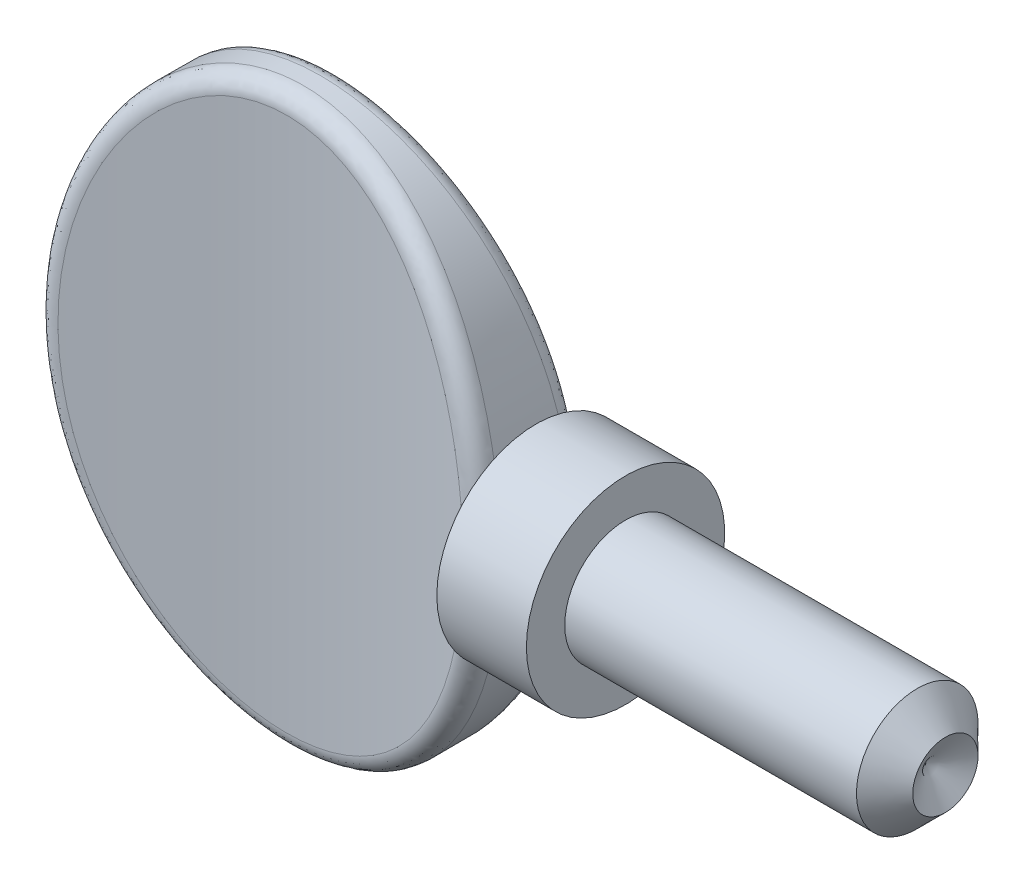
ISO-10303-21;
HEADER;
FILE_DESCRIPTION(('STEP AP214'),'2;1');
FILE_NAME('part.step','',(''),(''),'','','');
FILE_SCHEMA(('AUTOMOTIVE_DESIGN { 1 0 10303 214 1 1 1 1 }'));
ENDSEC;
DATA;
#1=APPLICATION_CONTEXT('core data for automotive mechanical design processes');
#2=APPLICATION_PROTOCOL_DEFINITION('international standard','automotive_design',2000,#1);
#3=PRODUCT_CONTEXT('',#1,'mechanical');
#4=PRODUCT('Part','Part','',(#3));
#5=PRODUCT_RELATED_PRODUCT_CATEGORY('part','',(#4));
#6=PRODUCT_DEFINITION_FORMATION('','',#4);
#7=PRODUCT_DEFINITION_CONTEXT('part definition',#1,'design');
#8=PRODUCT_DEFINITION('design','',#6,#7);
#9=PRODUCT_DEFINITION_SHAPE('','',#8);
#10=(LENGTH_UNIT() NAMED_UNIT(*) SI_UNIT(.MILLI.,.METRE.));
#11=(NAMED_UNIT(*) PLANE_ANGLE_UNIT() SI_UNIT($,.RADIAN.));
#12=(NAMED_UNIT(*) SI_UNIT($,.STERADIAN.) SOLID_ANGLE_UNIT());
#13=UNCERTAINTY_MEASURE_WITH_UNIT(LENGTH_MEASURE(1.E-05),#10,'distance_accuracy_value','');
#14=(GEOMETRIC_REPRESENTATION_CONTEXT(3) GLOBAL_UNCERTAINTY_ASSIGNED_CONTEXT((#13)) GLOBAL_UNIT_ASSIGNED_CONTEXT((#10,
#11,#12)) REPRESENTATION_CONTEXT('',''));
#15=CARTESIAN_POINT('',(0.,0.,0.));
#16=DIRECTION('',(0.,0.,1.));
#17=DIRECTION('',(1.,0.,0.));
#18=AXIS2_PLACEMENT_3D('',#15,#16,#17);
#19=CARTESIAN_POINT('',(0.,0.,2.286));
#20=DIRECTION('',(0.,0.,1.));
#21=DIRECTION('',(0.,1.,0.));
#22=AXIS2_PLACEMENT_3D('',#19,#20,#21);
#23=ELLIPSE('',#22,11.303,8.89);
#24=DIRECTION('',(0.,0.,-1.));
#25=VECTOR('',#24,1.);
#26=SURFACE_OF_LINEAR_EXTRUSION('',#23,#25);
#27=CARTESIAN_POINT('',(8.65241868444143,-2.59563035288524,1.41565744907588));
#28=CARTESIAN_POINT('',(8.64505380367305,-2.63527789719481,1.31316697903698));
#29=CARTESIAN_POINT('',(8.63830595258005,-2.67071705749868,1.20899028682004));
#30=CARTESIAN_POINT('',(8.62627848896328,-2.732857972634,0.997954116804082));
#31=CARTESIAN_POINT('',(8.6209992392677,-2.75955756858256,0.891093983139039));
#32=CARTESIAN_POINT('',(8.61214578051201,-2.8038850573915,0.675401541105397));
#33=CARTESIAN_POINT('',(8.60857205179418,-2.82151039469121,0.566568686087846));
#34=CARTESIAN_POINT('',(8.60328452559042,-2.84746342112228,0.347770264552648));
#35=CARTESIAN_POINT('',(8.60157044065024,-2.85579254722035,0.23780487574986));
#36=CARTESIAN_POINT('',(8.60008413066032,-2.86301911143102,0.018538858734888));
#37=CARTESIAN_POINT('',(8.60029463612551,-2.86200042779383,-0.0907588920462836));
#38=CARTESIAN_POINT('',(8.60260692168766,-2.8507444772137,-0.308858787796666));
#39=CARTESIAN_POINT('',(8.60470870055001,-2.8405072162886,-0.417660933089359));
#40=CARTESIAN_POINT('',(8.61070632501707,-2.810972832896,-0.633744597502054));
#41=CARTESIAN_POINT('',(8.61459849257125,-2.79169428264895,-0.741028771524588));
#42=CARTESIAN_POINT('',(8.62400975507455,-2.74432029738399,-0.953510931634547));
#43=CARTESIAN_POINT('',(8.62952797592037,-2.71622959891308,-1.05871000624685));
#44=CARTESIAN_POINT('',(8.63844994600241,-2.66982167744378,-1.20771767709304));
#45=CARTESIAN_POINT('',(8.64128872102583,-2.65493954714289,-1.25265626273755));
#46=CARTESIAN_POINT('',(8.64720516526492,-2.62361466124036,-1.34191094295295));
#47=CARTESIAN_POINT('',(8.65028255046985,-2.60717375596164,-1.3862277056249));
#48=CARTESIAN_POINT('',(8.65346985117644,-2.58995946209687,-1.43023949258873));
#49=B_SPLINE_CURVE_WITH_KNOTS('',3,(#27,#28,#29,#30,#31,#32,#33,#34,#35,#36,#37,#38,#39,#40,#41,
#42,#43,#44,#45,#46,#47,#48),.UNSPECIFIED.,.F.,.F.,(4,2,2,2,2,2,2,2,2,2,4),(0.,
0.330340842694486,0.660763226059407,0.991278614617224,1.3217429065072,1.64924484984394,
1.97674657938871,2.30357849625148,2.63023504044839,2.772481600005,2.91456137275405),.UNSPECIFIED.);
#50=CARTESIAN_POINT('',(8.64686129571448,-2.62539678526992,1.33619092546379));
#51=VERTEX_POINT('',#50);
#52=CARTESIAN_POINT('',(8.64686129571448,-2.62539678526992,-1.33619092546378));
#53=VERTEX_POINT('',#52);
#54=EDGE_CURVE('E170',#51,#53,#49,.T.);
#55=ORIENTED_EDGE('',*,*,#54,.F.);
#56=CARTESIAN_POINT('',(7.82629564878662,2.4351042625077,1.99569619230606));
#57=CARTESIAN_POINT('',(8.65245132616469,2.59576258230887,2.20582536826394));
#58=CARTESIAN_POINT('',(8.65956685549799,2.55680519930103,1.33926304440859));
#59=CARTESIAN_POINT('',(7.94743912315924,1.75770532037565,2.02649942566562));
#60=CARTESIAN_POINT('',(8.78692406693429,1.87112905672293,2.24349586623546));
#61=CARTESIAN_POINT('',(8.78960914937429,1.8448432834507,1.37072341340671));
#62=CARTESIAN_POINT('',(8.01716971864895,1.07004055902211,2.0448717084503));
#63=CARTESIAN_POINT('',(8.86351312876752,1.1404733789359,2.26573738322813));
#64=CARTESIAN_POINT('',(8.86432478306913,1.12299912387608,1.38948763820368));
#65=CARTESIAN_POINT('',(8.0547289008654,-0.309351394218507,2.05469325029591));
#66=CARTESIAN_POINT('',(8.90506846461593,-0.330332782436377,2.27771295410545));
#67=CARTESIAN_POINT('',(8.90458477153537,-0.324674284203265,1.399518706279));
#68=CARTESIAN_POINT('',(8.02243825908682,-1.00108239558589,2.04611100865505));
#69=CARTESIAN_POINT('',(8.86961883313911,-1.06541121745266,2.26732632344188));
#70=CARTESIAN_POINT('',(8.87000139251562,-1.05050720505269,1.39075337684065));
#71=CARTESIAN_POINT('',(7.89401839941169,-2.05341820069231,2.01297572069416));
#72=CARTESIAN_POINT('',(8.7273712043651,-2.18848798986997,2.22688533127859));
#73=CARTESIAN_POINT('',(8.7322517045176,-2.15566998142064,1.35691120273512));
#74=CARTESIAN_POINT('',(7.83428558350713,-2.41932216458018,1.99763575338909));
#75=CARTESIAN_POINT('',(8.66147254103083,-2.57804176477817,2.20823888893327));
#76=CARTESIAN_POINT('',(8.66816384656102,-2.54012241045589,1.34124398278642));
#77=CARTESIAN_POINT('',(7.68487396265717,-3.14447608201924,1.95997275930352));
#78=CARTESIAN_POINT('',(8.49634767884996,-3.35051128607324,2.16238668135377));
#79=CARTESIAN_POINT('',(8.50770464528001,-3.302633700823,1.30277751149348));
#80=CARTESIAN_POINT('',(7.59519051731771,-3.50372499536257,1.93764865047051));
#81=CARTESIAN_POINT('',(8.39743269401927,-3.73273694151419,2.13526405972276));
#82=CARTESIAN_POINT('',(8.41132829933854,-3.68069156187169,1.27997715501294));
#83=CARTESIAN_POINT('',(7.38556781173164,-4.21216799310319,1.88675959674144));
#84=CARTESIAN_POINT('',(8.16589203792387,-4.48682518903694,2.07336294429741));
#85=CARTESIAN_POINT('',(8.18576943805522,-4.42707064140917,1.22800246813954));
#86=CARTESIAN_POINT('',(7.26565071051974,-4.56136923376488,1.8581992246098));
#87=CARTESIAN_POINT('',(8.0337174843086,-4.85809981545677,2.03869510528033));
#88=CARTESIAN_POINT('',(8.05661094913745,-4.79539877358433,1.19883280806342));
#89=CARTESIAN_POINT('',(6.995124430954,-5.2464697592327,1.79585403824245));
#90=CARTESIAN_POINT('',(7.73510821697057,-5.5867008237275,1.96294144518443));
#91=CARTESIAN_POINT('',(7.76473855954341,-5.51911593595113,1.13515759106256));
#92=CARTESIAN_POINT('',(6.84452615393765,-5.58237371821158,1.76207108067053));
#93=CARTESIAN_POINT('',(7.56920233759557,-5.94356882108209,1.92197039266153));
#94=CARTESIAN_POINT('',(7.60203657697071,-5.87450950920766,1.10065393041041));
#95=CARTESIAN_POINT('',(6.43324199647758,-6.39240336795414,1.67357133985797));
#96=CARTESIAN_POINT('',(7.1165122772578,-6.80243787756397,1.81477728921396));
#97=CARTESIAN_POINT('',(7.15675137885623,-6.73320066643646,1.01026619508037));
#98=CARTESIAN_POINT('',(6.15417610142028,-6.85676635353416,1.61651047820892));
#99=CARTESIAN_POINT('',(6.80972916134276,-7.29531731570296,1.74570436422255));
#100=CARTESIAN_POINT('',(6.85386362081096,-7.22695535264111,0.951988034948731));
#101=CARTESIAN_POINT('',(5.52696453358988,-7.73305703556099,1.49913786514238));
#102=CARTESIAN_POINT('',(6.11796499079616,-8.22578037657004,1.60333969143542));
#103=CARTESIAN_POINT('',(6.17012522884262,-8.16227422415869,0.832111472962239));
#104=CARTESIAN_POINT('',(5.1789299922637,-8.14506735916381,1.43883145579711));
#105=CARTESIAN_POINT('',(5.73502064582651,-8.66343687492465,1.53025899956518));
#106=CARTESIAN_POINT('',(5.78939998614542,-8.60392057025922,0.770518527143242));
#107=CARTESIAN_POINT('',(4.49456535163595,-8.81832678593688,1.33426170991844));
#108=CARTESIAN_POINT('',(4.97849314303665,-9.37945459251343,1.4032069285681));
#109=CARTESIAN_POINT('',(5.0366311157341,-9.32899377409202,0.663717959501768));
#110=CARTESIAN_POINT('',(4.17119435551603,-9.09305461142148,1.28929359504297));
#111=CARTESIAN_POINT('',(4.62171828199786,-9.67163474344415,1.34859286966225));
#112=CARTESIAN_POINT('',(4.67963160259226,-9.62615608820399,0.617790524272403));
#113=CARTESIAN_POINT('',(3.65633336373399,-9.46244525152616,1.22675958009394));
#114=CARTESIAN_POINT('',(4.05119027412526,-10.0652330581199,1.27244557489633));
#115=CARTESIAN_POINT('',(4.10859190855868,-10.0272910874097,0.553922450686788));
#116=CARTESIAN_POINT('',(3.47966977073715,-9.5784960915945,1.2067276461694));
#117=CARTESIAN_POINT('',(3.85593810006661,-10.1886210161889,1.24810451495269));
#118=CARTESIAN_POINT('',(3.91223716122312,-10.1536091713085,0.533463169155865));
#119=CARTESIAN_POINT('',(3.11708209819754,-9.79472651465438,1.16885648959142));
#120=CARTESIAN_POINT('',(3.45504248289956,-10.4184405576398,1.20209344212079));
#121=CARTESIAN_POINT('',(3.50833839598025,-10.3894449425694,0.494784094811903));
#122=CARTESIAN_POINT('',(2.93116240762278,-9.89491352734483,1.15101624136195));
#123=CARTESIAN_POINT('',(3.2493632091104,-10.5250344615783,1.18039540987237));
#124=CARTESIAN_POINT('',(3.30079967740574,-10.4989704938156,0.476563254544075));
#125=CARTESIAN_POINT('',(2.54905941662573,-10.0787208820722,1.11790469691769));
#126=CARTESIAN_POINT('',(2.82653251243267,-10.7204996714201,1.14013561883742));
#127=CARTESIAN_POINT('',(2.87336447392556,-10.7002891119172,0.442745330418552));
#128=CARTESIAN_POINT('',(2.35279103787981,-10.162162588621,1.10266133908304));
#129=CARTESIAN_POINT('',(2.60916890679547,-10.8093536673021,1.12157484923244));
#130=CARTESIAN_POINT('',(2.65336386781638,-10.7918907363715,0.427176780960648));
#131=CARTESIAN_POINT('',(1.95321853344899,-10.3095327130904,1.0755046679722));
#132=CARTESIAN_POINT('',(2.16659574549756,-10.9661742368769,1.08852563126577));
#133=CARTESIAN_POINT('',(2.20463537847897,-10.9539332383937,0.399440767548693));
#134=CARTESIAN_POINT('',(1.74991833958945,-10.3734718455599,1.06358952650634));
#135=CARTESIAN_POINT('',(1.94121514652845,-11.0343149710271,1.07400206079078));
#136=CARTESIAN_POINT('',(1.97591236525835,-11.0243857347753,0.387271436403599));
#137=CARTESIAN_POINT('',(1.33807057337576,-10.4804542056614,1.04353897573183));
#138=CARTESIAN_POINT('',(1.48468245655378,-11.1482227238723,1.04958182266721));
#139=CARTESIAN_POINT('',(1.51188091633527,-11.1424052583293,0.366793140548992));
#140=CARTESIAN_POINT('',(1.12952697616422,-10.5235127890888,1.03540078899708));
#141=CARTESIAN_POINT('',(1.2532927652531,-11.1941423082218,1.03965311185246));
#142=CARTESIAN_POINT('',(1.27657745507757,-11.1899891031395,0.358481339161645));
#143=CARTESIAN_POINT('',(0.709126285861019,-10.5877622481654,1.02322405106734));
#144=CARTESIAN_POINT('',(0.787001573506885,-11.2625799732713,1.02481403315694));
#145=CARTESIAN_POINT('',(0.8017907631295,-11.2610341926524,0.346044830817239));
#146=CARTESIAN_POINT('',(0.49726981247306,-10.6089571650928,1.01918474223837));
#147=CARTESIAN_POINT('',(0.55180519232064,-11.2851925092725,1.0198833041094));
#148=CARTESIAN_POINT('',(0.562308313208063,-11.2844998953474,0.341919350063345));
#149=CARTESIAN_POINT('',(0.105050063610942,-10.627432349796,1.01566371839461));
#150=CARTESIAN_POINT('',(0.116614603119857,-11.3048795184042,1.01559044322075));
#151=CARTESIAN_POINT('',(0.118812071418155,-11.304954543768,0.338323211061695));
#152=CARTESIAN_POINT('',(-0.0751715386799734,-10.6278758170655,1.01557916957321));
#153=CARTESIAN_POINT('',(-0.0834564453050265,-11.3053519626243,1.01548738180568));
#154=CARTESIAN_POINT('',(-0.0850214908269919,-11.3054455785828,0.338236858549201));
#155=CARTESIAN_POINT('',(-0.434937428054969,-10.6127090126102,1.01846977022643));
#156=CARTESIAN_POINT('',(-0.482622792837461,-11.2891920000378,1.01901126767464));
#157=CARTESIAN_POINT('',(-0.491831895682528,-11.2886536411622,0.341189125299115));
#158=CARTESIAN_POINT('',(-0.614481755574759,-10.5970997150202,1.02144473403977));
#159=CARTESIAN_POINT('',(-0.681915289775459,-11.2725446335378,1.0226414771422));
#160=CARTESIAN_POINT('',(-0.694808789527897,-11.2713717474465,0.34422755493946));
#161=CARTESIAN_POINT('',(-0.971475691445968,-10.5501136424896,1.03036356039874));
#162=CARTESIAN_POINT('',(-1.0779135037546,-11.2224918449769,1.03351143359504));
#163=CARTESIAN_POINT('',(-1.0981231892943,-11.2193981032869,0.353336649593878));
#164=CARTESIAN_POINT('',(-1.14892554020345,-10.5187386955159,1.03630707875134));
#165=CARTESIAN_POINT('',(-1.27480360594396,-11.1890405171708,1.04076111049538));
#166=CARTESIAN_POINT('',(-1.29846099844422,-11.1847083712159,0.359406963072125));
#167=CARTESIAN_POINT('',(-1.50046734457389,-10.4407724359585,1.05098693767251));
#168=CARTESIAN_POINT('',(-1.66458038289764,-11.1060123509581,1.05864455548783));
#169=CARTESIAN_POINT('',(-1.69492269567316,-11.0986163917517,0.374399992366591));
#170=CARTESIAN_POINT('',(-1.6745592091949,-10.3941807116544,1.05972335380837));
#171=CARTESIAN_POINT('',(-1.85762658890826,-11.056361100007,1.06929413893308));
#172=CARTESIAN_POINT('',(-1.89104646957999,-11.047213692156,0.383322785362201));
#173=CARTESIAN_POINT('',(-2.01159554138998,-10.2886238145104,1.07935663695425));
#174=CARTESIAN_POINT('',(-2.23106714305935,-10.9440082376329,1.09319591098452));
#175=CARTESIAN_POINT('',(-2.27021161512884,-10.9309431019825,0.403374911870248));
#176=CARTESIAN_POINT('',(-2.17471076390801,-10.2302066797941,1.0901569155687));
#177=CARTESIAN_POINT('',(-2.4117997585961,-10.8817955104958,1.10635018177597));
#178=CARTESIAN_POINT('',(-2.45346562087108,-10.8666726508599,0.414405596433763));
#179=CARTESIAN_POINT('',(-2.4959633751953,-10.1008201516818,1.11384924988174));
#180=CARTESIAN_POINT('',(-2.76753136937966,-10.744137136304,1.13517612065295));
#181=CARTESIAN_POINT('',(-2.81382794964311,-10.7245661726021,0.438603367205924));
#182=CARTESIAN_POINT('',(-2.6540991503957,-10.0298467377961,1.12674197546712));
#183=CARTESIAN_POINT('',(-2.94261127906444,-10.6685976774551,1.15086640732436));
#184=CARTESIAN_POINT('',(-2.99093428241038,-10.6467258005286,0.451771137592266));
#185=CARTESIAN_POINT('',(-3.11989632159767,-9.79942559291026,1.16812424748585));
#186=CARTESIAN_POINT('',(-3.45909560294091,-10.4230523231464,1.20128501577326));
#187=CARTESIAN_POINT('',(-3.51173172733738,-10.394478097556,0.494036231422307));
#188=CARTESIAN_POINT('',(-3.41911154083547,-9.62242439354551,1.19932790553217));
#189=CARTESIAN_POINT('',(-3.79004687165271,-10.2345494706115,1.23926399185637));
#190=CARTESIAN_POINT('',(-3.84508579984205,-10.20128606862,0.52590556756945));
#191=CARTESIAN_POINT('',(-4.09904643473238,-9.15457953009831,1.27920788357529));
#192=CARTESIAN_POINT('',(-4.54276316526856,-9.7366002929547,1.33643019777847));
#193=CARTESIAN_POINT('',(-4.59999386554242,-9.69271674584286,0.607489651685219));
#194=CARTESIAN_POINT('',(-4.4677733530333,-8.84600074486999,1.33002831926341));
#195=CARTESIAN_POINT('',(-4.94952770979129,-9.40827652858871,1.39816929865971));
#196=CARTESIAN_POINT('',(-5.00720170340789,-9.35876546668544,0.659394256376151));
#197=CARTESIAN_POINT('',(-5.1506512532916,-8.17151649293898,1.43465606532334));
#198=CARTESIAN_POINT('',(-5.70311367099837,-8.69214633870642,1.52508390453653));
#199=CARTESIAN_POINT('',(-5.75825220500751,-8.63243872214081,0.766254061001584));
#200=CARTESIAN_POINT('',(-5.46469809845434,-7.80550411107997,1.48846882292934));
#201=CARTESIAN_POINT('',(-6.04883115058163,-8.30338280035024,1.59030661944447));
#202=CARTESIAN_POINT('',(-6.10197403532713,-8.23995436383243,0.821214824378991));
#203=CARTESIAN_POINT('',(-6.11532335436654,-6.92506403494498,1.6082879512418));
#204=CARTESIAN_POINT('',(-6.76780893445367,-7.36679603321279,1.7359003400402));
#205=CARTESIAN_POINT('',(-6.81177427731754,-7.29951289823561,0.943590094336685));
#206=CARTESIAN_POINT('',(-6.43476934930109,-6.39735552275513,1.67362664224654));
#207=CARTESIAN_POINT('',(-7.11866978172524,-6.80670608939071,1.81495566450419));
#208=CARTESIAN_POINT('',(-7.15847428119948,-6.73831516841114,1.01032267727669));
#209=CARTESIAN_POINT('',(-6.98586982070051,-5.29504721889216,1.79279155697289));
#210=CARTESIAN_POINT('',(-7.72672939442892,-5.63515267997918,1.95964859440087));
#211=CARTESIAN_POINT('',(-7.75498793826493,-5.57007516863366,1.13202977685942));
#212=CARTESIAN_POINT('',(-7.21743550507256,-4.72040071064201,1.84660611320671));
#213=CARTESIAN_POINT('',(-7.98107986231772,-5.02517153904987,2.02476167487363));
#214=CARTESIAN_POINT('',(-8.00470360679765,-4.96298727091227,1.18699237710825));
#215=CARTESIAN_POINT('',(-7.59788704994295,-3.53286241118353,1.93787390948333));
#216=CARTESIAN_POINT('',(-8.40127783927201,-3.76125290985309,2.13576419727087));
#217=CARTESIAN_POINT('',(-8.41432758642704,-3.71108875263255,1.28020721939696));
#218=CARTESIAN_POINT('',(-7.74551320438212,-2.91953395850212,1.97507615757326));
#219=CARTESIAN_POINT('',(-8.56353360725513,-3.10968614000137,2.18081781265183));
#220=CARTESIAN_POINT('',(-8.572867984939,-3.06585606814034,1.31820311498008));
#221=CARTESIAN_POINT('',(-7.95444111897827,-1.67779030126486,2.02838222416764));
#222=CARTESIAN_POINT('',(-8.79452477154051,-1.78651139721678,2.24575202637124));
#223=CARTESIAN_POINT('',(-8.79710310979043,-1.76097068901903,1.37264637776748));
#224=CARTESIAN_POINT('',(-8.01589074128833,-1.04940282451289,2.04452217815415));
#225=CARTESIAN_POINT('',(-8.86213168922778,-1.11847428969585,2.26532120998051));
#226=CARTESIAN_POINT('',(-8.86295686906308,-1.10134467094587,1.38913065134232));
#227=CARTESIAN_POINT('',(-8.04339962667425,-0.134428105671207,2.05173737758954));
#228=CARTESIAN_POINT('',(-8.89250870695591,-0.143244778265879,2.27410147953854));
#229=CARTESIAN_POINT('',(-8.89243947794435,-0.141070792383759,1.39649977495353));
#230=CARTESIAN_POINT('',(-8.04322422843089,0.151433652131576,2.05168672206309));
#231=CARTESIAN_POINT('',(-8.89232438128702,0.161377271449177,2.2740424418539));
#232=CARTESIAN_POINT('',(-8.8922524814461,0.158917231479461,1.39644803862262));
#233=CARTESIAN_POINT('',(-8.02535656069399,0.722706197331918,2.04701032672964));
#234=CARTESIAN_POINT('',(-8.87256700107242,0.770474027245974,2.26834414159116));
#235=CARTESIAN_POINT('',(-8.87310070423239,0.758474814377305,1.39167188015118));
#236=CARTESIAN_POINT('',(-8.00765727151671,1.00811675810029,2.04238275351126));
#237=CARTESIAN_POINT('',(-8.85300951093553,1.07458955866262,2.26270936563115));
#238=CARTESIAN_POINT('',(-8.85412839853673,1.05804415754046,1.3869455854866));
#239=CARTESIAN_POINT('',(-7.947886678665,1.6500558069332,2.02685880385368));
#240=CARTESIAN_POINT('',(-8.78692419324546,1.75875334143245,2.24379627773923));
#241=CARTESIAN_POINT('',(-8.79003704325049,1.73201243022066,1.37109045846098));
#242=CARTESIAN_POINT('',(-7.90073256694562,2.00606858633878,2.01465999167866));
#243=CARTESIAN_POINT('',(-8.73487578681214,2.1378622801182,2.22895949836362));
#244=CARTESIAN_POINT('',(-8.73946402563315,2.10591711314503,1.35863140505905));
#245=CARTESIAN_POINT('',(-7.77848949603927,2.71274841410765,1.98351195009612));
#246=CARTESIAN_POINT('',(-8.5997385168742,2.89083812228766,2.19102428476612));
#247=CARTESIAN_POINT('',(-8.6082550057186,2.84858479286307,1.3268188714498));
#248=CARTESIAN_POINT('',(-7.70339994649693,3.063415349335,1.9645625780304));
#249=CARTESIAN_POINT('',(-8.51689426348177,3.26405432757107,2.16799271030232));
#250=CARTESIAN_POINT('',(-8.52761836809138,3.21734768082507,1.30746524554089));
#251=CARTESIAN_POINT('',(-7.52482874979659,3.75734261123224,1.92045005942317));
#252=CARTESIAN_POINT('',(-8.3196020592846,4.00293869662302,2.11431336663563));
#253=CARTESIAN_POINT('',(-8.33564394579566,3.94777946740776,1.26241165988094));
#254=CARTESIAN_POINT('',(-7.42130346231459,4.10059067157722,1.89527736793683));
#255=CARTESIAN_POINT('',(-8.20545267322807,4.36801638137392,2.0837427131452));
#256=CARTESIAN_POINT('',(-8.22425897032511,4.30943653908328,1.23670195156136));
#257=CARTESIAN_POINT('',(-7.18557888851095,4.77601163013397,1.83956259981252));
#258=CARTESIAN_POINT('',(-7.94517850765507,5.08660176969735,2.01601312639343));
#259=CARTESIAN_POINT('',(-7.97026371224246,5.02200340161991,1.17979860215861));
#260=CARTESIAN_POINT('',(-7.05338947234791,5.10818829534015,1.80902237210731));
#261=CARTESIAN_POINT('',(-7.79950129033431,5.43963428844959,1.97895746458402));
#262=CARTESIAN_POINT('',(-7.8276641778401,5.37291684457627,1.14860684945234));
#263=CARTESIAN_POINT('',(-6.67495246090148,5.94632514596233,1.72466643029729));
#264=CARTESIAN_POINT('',(-7.38297359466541,6.32842399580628,1.8767643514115));
#265=CARTESIAN_POINT('',(-7.4186740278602,6.25981775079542,1.06245131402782));
#266=CARTESIAN_POINT('',(-6.40690462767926,6.44195824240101,1.66758899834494));
#267=CARTESIAN_POINT('',(-7.08838989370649,6.8544708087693,1.80768456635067));
#268=CARTESIAN_POINT('',(-7.12833321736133,6.78575428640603,1.00415623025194));
#269=CARTESIAN_POINT('',(-5.79654461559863,7.38178409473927,1.54807423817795));
#270=CARTESIAN_POINT('',(-6.41517877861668,7.85259495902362,1.66268974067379));
#271=CARTESIAN_POINT('',(-6.46441231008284,7.78670698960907,0.882091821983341));
#272=CARTESIAN_POINT('',(-5.45436166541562,7.82606432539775,1.48564634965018));
#273=CARTESIAN_POINT('',(-6.03887887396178,8.32439730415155,1.58707563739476));
#274=CARTESIAN_POINT('',(-6.09097702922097,8.26180964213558,0.81833213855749));
#275=CARTESIAN_POINT('',(-4.77789167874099,8.55448470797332,1.37612062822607));
#276=CARTESIAN_POINT('',(-5.29119543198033,9.09910698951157,1.45400801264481));
#277=CARTESIAN_POINT('',(-5.34869298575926,9.04439141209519,0.70646986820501));
#278=CARTESIAN_POINT('',(-4.45799420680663,8.85245688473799,1.32863499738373));
#279=CARTESIAN_POINT('',(-4.93851328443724,9.41585809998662,1.39637707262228));
#280=CARTESIAN_POINT('',(-4.99642235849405,9.36587548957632,0.65797121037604));
#281=CARTESIAN_POINT('',(-3.77461012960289,9.39190551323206,1.23929408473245));
#282=CARTESIAN_POINT('',(-4.18378611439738,9.98880971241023,1.2879446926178));
#283=CARTESIAN_POINT('',(-4.24030383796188,9.95027102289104,0.566724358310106));
#284=CARTESIAN_POINT('',(-3.41117328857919,9.63344555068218,1.19743248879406));
#285=CARTESIAN_POINT('',(-3.78213052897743,10.2460992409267,1.237002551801));
#286=CARTESIAN_POINT('',(-3.83651479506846,10.2132483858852,0.523969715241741));
#287=CARTESIAN_POINT('',(-2.7071131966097,10.0130852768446,1.12997552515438));
#288=CARTESIAN_POINT('',(-3.00265612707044,10.6500345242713,1.15495053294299));
#289=CARTESIAN_POINT('',(-3.05059237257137,10.6281650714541,0.455073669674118));
#290=CARTESIAN_POINT('',(-2.37204630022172,10.1615243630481,1.10285226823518));
#291=CARTESIAN_POINT('',(-2.63139042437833,10.8083853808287,1.12186903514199));
#292=CARTESIAN_POINT('',(-2.67521894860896,10.7911098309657,0.427371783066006));
#293=CARTESIAN_POINT('',(-1.85473120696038,10.3404490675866,1.06974582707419));
#294=CARTESIAN_POINT('',(-2.05733540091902,10.9991414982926,1.08150227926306));
#295=CARTESIAN_POINT('',(-2.09383679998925,10.9879949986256,0.393559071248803));
#296=CARTESIAN_POINT('',(-1.67979337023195,10.3928095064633,1.05997187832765));
#297=CARTESIAN_POINT('',(-1.86339026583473,11.0549303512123,1.06959065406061));
#298=CARTESIAN_POINT('',(-1.89693593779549,11.045710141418,0.383576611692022));
#299=CARTESIAN_POINT('',(-1.32608818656,10.4821521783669,1.04321230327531));
#300=CARTESIAN_POINT('',(-1.47128411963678,11.1500600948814,1.04917741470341));
#301=CARTESIAN_POINT('',(-1.49833774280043,11.1442889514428,0.366459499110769));
#302=CARTESIAN_POINT('',(-1.14732240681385,10.5191405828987,1.03622555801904));
#303=CARTESIAN_POINT('',(-1.27297000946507,11.1894916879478,1.04065670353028));
#304=CARTESIAN_POINT('',(-1.29664236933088,11.1851593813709,0.359323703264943));
#305=CARTESIAN_POINT('',(-0.786475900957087,10.5772111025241,1.02522674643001));
#306=CARTESIAN_POINT('',(-0.872750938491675,11.2513466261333,1.0272534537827));
#307=CARTESIAN_POINT('',(-0.8891721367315,11.2493631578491,0.348090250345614));
#308=CARTESIAN_POINT('',(-0.604384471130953,10.5982263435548,1.02122718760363));
#309=CARTESIAN_POINT('',(-0.670646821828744,11.2737587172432,1.02237324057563));
#310=CARTESIAN_POINT('',(-0.683383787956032,11.2726227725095,0.344005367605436));
#311=CARTESIAN_POINT('',(-0.239046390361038,10.6237097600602,1.01637444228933));
#312=CARTESIAN_POINT('',(-0.265317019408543,11.3009091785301,1.01645776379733));
#313=CARTESIAN_POINT('',(-0.270347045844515,11.3008314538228,0.339049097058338));
#314=CARTESIAN_POINT('',(-0.0557997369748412,10.6281779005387,1.01552126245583));
#315=CARTESIAN_POINT('',(-0.0618866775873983,11.3056751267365,1.01541649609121));
#316=CARTESIAN_POINT('',(-0.0630986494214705,11.3057804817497,0.338177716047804));
#317=CARTESIAN_POINT('',(0.310342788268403,10.6204795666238,1.01698891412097));
#318=CARTESIAN_POINT('',(0.344362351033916,11.2974728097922,1.01720566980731));
#319=CARTESIAN_POINT('',(0.350954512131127,11.2972566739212,0.339676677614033));
#320=CARTESIAN_POINT('',(0.493238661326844,10.6083131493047,1.0193097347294));
#321=CARTESIAN_POINT('',(0.547389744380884,11.2844961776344,1.02003793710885));
#322=CARTESIAN_POINT('',(0.557759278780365,11.2837839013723,0.342047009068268));
#323=CARTESIAN_POINT('',(0.857193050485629,10.5675786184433,1.02705146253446));
#324=CARTESIAN_POINT('',(0.951137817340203,11.2411005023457,1.02947400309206));
#325=CARTESIAN_POINT('',(0.969049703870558,11.2387130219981,0.349953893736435));
#326=CARTESIAN_POINT('',(1.03825162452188,10.5390110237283,1.03247227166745));
#327=CARTESIAN_POINT('',(1.15205642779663,11.2106386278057,1.03608708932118));
#328=CARTESIAN_POINT('',(1.17353543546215,11.2071154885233,0.355490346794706));
#329=CARTESIAN_POINT('',(1.38577241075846,10.4683102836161,1.04581044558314));
#330=CARTESIAN_POINT('',(1.53738746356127,11.1353476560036,1.05233647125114));
#331=CARTESIAN_POINT('',(1.56562555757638,11.1290138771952,0.36911306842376));
#332=CARTESIAN_POINT('',(1.55243251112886,10.4271514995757,1.05354783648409));
#333=CARTESIAN_POINT('',(1.72221209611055,11.0914846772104,1.06176887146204));
#334=CARTESIAN_POINT('',(1.75347855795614,11.0835813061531,0.377015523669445));
#335=CARTESIAN_POINT('',(1.88194456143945,10.3315323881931,1.07139376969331));
#336=CARTESIAN_POINT('',(2.08740434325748,10.9896901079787,1.08349994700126));
#337=CARTESIAN_POINT('',(2.12443081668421,10.9781855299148,0.395242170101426));
#338=CARTESIAN_POINT('',(2.0447952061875,10.2770675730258,1.08150311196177));
#339=CARTESIAN_POINT('',(2.26788778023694,10.9316775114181,1.09581547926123));
#340=CARTESIAN_POINT('',(2.30752844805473,10.9182174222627,0.405567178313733));
#341=CARTESIAN_POINT('',(2.52615676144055,10.0948432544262,1.11502540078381));
#342=CARTESIAN_POINT('',(2.80192013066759,10.7374389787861,1.13667911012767));
#343=CARTESIAN_POINT('',(2.84792805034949,10.7179160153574,0.439804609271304));
#344=CARTESIAN_POINT('',(2.83775186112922,9.94819639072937,1.14164376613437));
#345=CARTESIAN_POINT('',(3.14702031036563,10.5810992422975,1.16912176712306));
#346=CARTESIAN_POINT('',(3.19664674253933,10.5571217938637,0.466990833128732));
#347=CARTESIAN_POINT('',(3.46147687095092,9.59774159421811,1.20356654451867));
#348=CARTESIAN_POINT('',(3.83708974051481,10.2084377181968,1.24439518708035));
#349=CARTESIAN_POINT('',(3.89231625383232,10.1744153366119,0.530234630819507));
#350=CARTESIAN_POINT('',(3.77151791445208,9.3902081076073,1.23940741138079));
#351=CARTESIAN_POINT('',(4.17970555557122,9.98753738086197,1.28798248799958));
#352=CARTESIAN_POINT('',(4.23673354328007,9.94854700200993,0.56684010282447));
#353=CARTESIAN_POINT('',(4.35991988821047,8.93336469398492,1.3153767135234));
#354=CARTESIAN_POINT('',(4.82954880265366,9.50230750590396,1.38018944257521));
#355=CARTESIAN_POINT('',(4.88803612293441,9.45342711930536,0.644430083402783));
#356=CARTESIAN_POINT('',(4.63825599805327,8.68402240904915,1.3555084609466));
#357=CARTESIAN_POINT('',(5.1365679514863,9.23728381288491,1.42890183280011));
#358=CARTESIAN_POINT('',(5.19489202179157,9.18414197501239,0.685417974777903));
#359=CARTESIAN_POINT('',(5.2883525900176,8.02265329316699,1.45704370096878));
#360=CARTESIAN_POINT('',(5.8558547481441,8.53323619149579,1.55237909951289));
#361=CARTESIAN_POINT('',(5.90931964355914,8.47252416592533,0.789119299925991));
#362=CARTESIAN_POINT('',(5.64019381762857,7.59026791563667,1.51934813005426));
#363=CARTESIAN_POINT('',(6.24288672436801,8.07397250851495,1.62786734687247));
#364=CARTESIAN_POINT('',(6.29382777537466,8.00948569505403,0.852752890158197));
#365=CARTESIAN_POINT('',(6.27033111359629,6.67225546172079,1.63966575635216));
#366=CARTESIAN_POINT('',(6.93790446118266,7.09909556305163,1.77382186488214));
#367=CARTESIAN_POINT('',(6.98009678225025,7.03057005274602,0.975637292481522));
#368=CARTESIAN_POINT('',(6.54850581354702,6.18654236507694,1.69767175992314));
#369=CARTESIAN_POINT('',(7.2436171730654,6.58356877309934,1.84402554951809));
#370=CARTESIAN_POINT('',(7.28172113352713,6.51460760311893,1.03488075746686));
#371=CARTESIAN_POINT('',(7.03636802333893,5.17052156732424,1.80448690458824));
#372=CARTESIAN_POINT('',(7.7819565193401,5.50356359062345,1.97373871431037));
#373=CARTESIAN_POINT('',(7.80945284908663,5.43850602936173,1.14397462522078));
#374=CARTESIAN_POINT('',(7.24495455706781,4.63964991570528,1.85314346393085));
#375=CARTESIAN_POINT('',(8.01126147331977,4.93984669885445,2.03265655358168));
#376=CARTESIAN_POINT('',(8.03434739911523,4.87781622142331,1.19366919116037));
#377=CARTESIAN_POINT('',(7.5896007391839,3.55324278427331,1.93595435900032));
#378=CARTESIAN_POINT('',(8.39188677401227,3.78362130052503,2.13336693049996));
#379=CARTESIAN_POINT('',(8.40539047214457,3.7326204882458,1.27824671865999));
#380=CARTESIAN_POINT('',(7.72568060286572,2.99771422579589,1.97011273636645));
#381=CARTESIAN_POINT('',(8.54157946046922,3.19321802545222,2.17476629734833));
#382=CARTESIAN_POINT('',(8.55156094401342,3.14812125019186,1.31313380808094));
#383=CARTESIAN_POINT('',(7.82629564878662,2.4351042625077,1.99569619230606));
#384=CARTESIAN_POINT('',(8.65245132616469,2.59576258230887,2.20582536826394));
#385=CARTESIAN_POINT('',(8.65956685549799,2.55680519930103,1.33926304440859));
#386=(BOUNDED_SURFACE() B_SPLINE_SURFACE(3,2,((#56,#57,#58),(#59,#60,#61),(#62,#63,#64),(#65,
#66,#67),(#68,#69,#70),(#71,#72,#73),(#74,#75,#76),(#77,#78,#79),(#80,#81,#82),(#83,#84,#85),
(#86,#87,#88),(#89,#90,#91),(#92,#93,#94),(#95,#96,#97),(#98,#99,#100),(#101,#102,#103),(#104,
#105,#106),(#107,#108,#109),(#110,#111,#112),(#113,#114,#115),(#116,#117,#118),(#119,#120,#121),
(#122,#123,#124),(#125,#126,#127),(#128,#129,#130),(#131,#132,#133),(#134,#135,#136),(#137,#138,
#139),(#140,#141,#142),(#143,#144,#145),(#146,#147,#148),(#149,#150,#151),(#152,#153,#154),
(#155,#156,#157),(#158,#159,#160),(#161,#162,#163),(#164,#165,#166),(#167,#168,#169),(#170,#171,
#172),(#173,#174,#175),(#176,#177,#178),(#179,#180,#181),(#182,#183,#184),(#185,#186,#187),
(#188,#189,#190),(#191,#192,#193),(#194,#195,#196),(#197,#198,#199),(#200,#201,#202),(#203,#204,
#205),(#206,#207,#208),(#209,#210,#211),(#212,#213,#214),(#215,#216,#217),(#218,#219,#220),
(#221,#222,#223),(#224,#225,#226),(#227,#228,#229),(#230,#231,#232),(#233,#234,#235),(#236,#237,
#238),(#239,#240,#241),(#242,#243,#244),(#245,#246,#247),(#248,#249,#250),(#251,#252,#253),
(#254,#255,#256),(#257,#258,#259),(#260,#261,#262),(#263,#264,#265),(#266,#267,#268),(#269,#270,
#271),(#272,#273,#274),(#275,#276,#277),(#278,#279,#280),(#281,#282,#283),(#284,#285,#286),
(#287,#288,#289),(#290,#291,#292),(#293,#294,#295),(#296,#297,#298),(#299,#300,#301),(#302,#303,
#304),(#305,#306,#307),(#308,#309,#310),(#311,#312,#313),(#314,#315,#316),(#317,#318,#319),
(#320,#321,#322),(#323,#324,#325),(#326,#327,#328),(#329,#330,#331),(#332,#333,#334),(#335,#336,
#337),(#338,#339,#340),(#341,#342,#343),(#344,#345,#346),(#347,#348,#349),(#350,#351,#352),
(#353,#354,#355),(#356,#357,#358),(#359,#360,#361),(#362,#363,#364),(#365,#366,#367),(#368,#369,
#370),(#371,#372,#373),(#374,#375,#376),(#377,#378,#379),(#380,#381,#382),(#383,#384,#385)),
.UNSPECIFIED.,.T.,.F.,.F.) B_SPLINE_SURFACE_WITH_KNOTS((4,2,2,2,2,2,2,2,2,2,2,2,2,2,2,2,2,2,2,2,
2,2,2,2,2,2,2,2,2,2,2,2,2,2,2,2,2,2,2,2,2,2,2,2,2,2,2,2,2,2,2,2,2,2,4),(3,3),(0.,
2.06622314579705,4.13486190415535,5.24755247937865,6.36041552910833,7.4724652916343,
8.58412061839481,10.2215277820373,11.8563176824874,13.1469674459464,13.792803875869,
14.4383369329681,15.0904277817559,15.7421597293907,16.3934116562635,17.0445431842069,
17.5960362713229,18.1474958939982,18.6988915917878,19.2503022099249,19.7803937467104,
20.3106553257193,21.3706565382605,22.831692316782,24.295480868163,26.1576819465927,
28.0217595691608,29.9131198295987,31.8012308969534,32.6583453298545,33.5158032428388,
34.5929671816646,35.6701538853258,36.7490030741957,37.8274813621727,39.5282876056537,
41.226152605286,42.5557025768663,43.883747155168,45.0006946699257,45.5594567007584,
46.1179941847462,46.6788573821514,47.2397217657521,47.8005842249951,48.3614289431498,
48.8867331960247,49.4122148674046,50.4623283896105,51.5993275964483,52.737210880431,
54.4254075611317,56.116368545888,57.8329376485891,59.5490279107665),(0.,1.),
.UNSPECIFIED.) GEOMETRIC_REPRESENTATION_ITEM() RATIONAL_B_SPLINE_SURFACE(((1.,0.615432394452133,
1.),(1.,0.61297474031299,1.),(1.,0.611532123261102,1.),(1.,0.610758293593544,1.),(1.,
0.611429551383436,1.),(1.,0.61405591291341,1.),(1.,0.615274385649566,1.),(1.,0.618290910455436,
1.),(1.,0.62008905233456,1.),(1.,0.624233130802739,1.),(1.,0.626578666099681,1.),(1.,
0.631770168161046,1.),(1.,0.634615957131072,1.),(1.,0.642197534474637,1.),(1.,0.647190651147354,
1.),(1.,0.657791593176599,1.),(1.,0.663398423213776,1.),(1.,0.673468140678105,1.),(1.,
0.677923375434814,1.),(1.,0.684287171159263,1.),(1.,0.686356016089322,1.),(1.,0.690317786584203,
1.),(1.,0.692210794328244,1.),(1.,0.695765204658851,1.),(1.,0.697424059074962,1.),(1.,
0.700407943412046,1.),(1.,0.701733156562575,1.),(1.,0.703978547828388,1.),(1.,0.70489902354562,
1.),(1.,0.706281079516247,1.),(1.,0.706742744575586,1.),(1.,0.707145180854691,1.),(1.,
0.707154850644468,1.),(1.,0.706824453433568,1.),(1.,0.706484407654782,1.),(1.,0.705470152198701,
1.),(1.,0.704795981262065,1.),(1.,0.703143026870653,1.),(1.,0.702164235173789,1.),(1.,
0.699984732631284,1.),(1.,0.698794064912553,1.),(1.,0.696208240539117,1.),(1.,0.69481301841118,
1.),(1.,0.6903842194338,1.),(1.,0.6871063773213,1.),(1.,0.678923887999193,1.),(1.,
0.673872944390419,1.),(1.,0.66380350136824,1.),(1.,0.658785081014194,1.),(1.,0.647904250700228,
1.),(1.,0.642183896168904,1.),(1.,0.63199434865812,1.),(1.,0.627526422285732,1.),(1.,
0.620055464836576,1.),(1.,0.617074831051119,1.),(1.,0.612828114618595,1.),(1.,0.611559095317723,
1.),(1.,0.610991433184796,1.),(1.,0.610995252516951,1.),(1.,0.611363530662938,1.),(1.,
0.611728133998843,1.),(1.,0.612954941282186,1.),(1.,0.613920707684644,1.),(1.,0.616403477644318,
1.),(1.,0.617920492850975,1.),(1.,0.621485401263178,1.),(1.,0.623534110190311,1.),(1.,
0.62812384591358,1.),(1.,0.630664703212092,1.),(1.,0.637788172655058,1.),(1.,0.642702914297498,
1.),(1.,0.653321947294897,1.),(1.,0.659024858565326,1.),(1.,0.669395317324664,1.),(1.,
0.674019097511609,1.),(1.,0.68297001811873,1.),(1.,0.687297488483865,1.),(1.,0.694444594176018,
1.),(1.,0.697394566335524,1.),(1.,0.701047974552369,1.),(1.,0.702137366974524,1.),(1.,
0.70401629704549,1.),(1.,0.704805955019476,1.),(1.,0.706053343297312,1.),(1.,0.706509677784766,
1.),(1.,0.707063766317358,1.),(1.,0.707161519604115,1.),(1.,0.706993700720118,1.),(1.,
0.706728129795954,1.),(1.,0.705846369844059,1.),(1.,0.705230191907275,1.),(1.,0.703724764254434,
1.),(1.,0.702855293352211,1.),(1.,0.700866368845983,1.),(1.,0.699746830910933,1.),(1.,
0.696070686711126,1.),(1.,0.693195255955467,1.),(1.,0.686667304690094,1.),(1.,0.682970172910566,
1.),(1.,0.675337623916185,1.),(1.,0.671402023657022,1.),(1.,0.661686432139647,1.),(1.,
0.655934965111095,1.),(1.,0.645145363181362,1.),(1.,0.64010841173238,1.),(1.,0.631022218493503,
1.),(1.,0.626989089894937,1.),(1.,0.620214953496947,1.),(1.,0.617473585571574,1.),(1.,
0.615432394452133,1.))) REPRESENTATION_ITEM('') SURFACE());
#387=CARTESIAN_POINT('',(8.65956685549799,2.55680519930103,1.33926304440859));
#388=CARTESIAN_POINT('',(8.78960914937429,1.8448432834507,1.37072341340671));
#389=CARTESIAN_POINT('',(8.86432478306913,1.12299912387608,1.38948763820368));
#390=CARTESIAN_POINT('',(8.90458477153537,-0.324674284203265,1.399518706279));
#391=CARTESIAN_POINT('',(8.87000139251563,-1.05050720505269,1.39075337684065));
#392=CARTESIAN_POINT('',(8.7322517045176,-2.15566998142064,1.35691120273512));
#393=CARTESIAN_POINT('',(8.66816384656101,-2.54012241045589,1.34124398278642));
#394=CARTESIAN_POINT('',(8.50770464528,-3.302633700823,1.30277751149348));
#395=CARTESIAN_POINT('',(8.41132829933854,-3.68069156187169,1.27997715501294));
#396=CARTESIAN_POINT('',(8.18576943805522,-4.42707064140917,1.22800246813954));
#397=CARTESIAN_POINT('',(8.05661094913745,-4.79539877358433,1.19883280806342));
#398=CARTESIAN_POINT('',(7.76473855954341,-5.51911593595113,1.13515759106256));
#399=CARTESIAN_POINT('',(7.60203657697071,-5.87450950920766,1.10065393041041));
#400=CARTESIAN_POINT('',(7.15675137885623,-6.73320066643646,1.01026619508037));
#401=CARTESIAN_POINT('',(6.85386362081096,-7.22695535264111,0.951988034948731));
#402=CARTESIAN_POINT('',(6.17012522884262,-8.16227422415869,0.832111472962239));
#403=CARTESIAN_POINT('',(5.78939998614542,-8.60392057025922,0.770518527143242));
#404=CARTESIAN_POINT('',(5.0366311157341,-9.32899377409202,0.663717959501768));
#405=CARTESIAN_POINT('',(4.67963160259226,-9.62615608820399,0.617790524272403));
#406=CARTESIAN_POINT('',(4.10859190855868,-10.0272910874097,0.553922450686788));
#407=CARTESIAN_POINT('',(3.91223716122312,-10.1536091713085,0.533463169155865));
#408=CARTESIAN_POINT('',(3.50833839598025,-10.3894449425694,0.494784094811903));
#409=CARTESIAN_POINT('',(3.30079967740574,-10.4989704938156,0.476563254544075));
#410=CARTESIAN_POINT('',(2.87336447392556,-10.7002891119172,0.442745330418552));
#411=CARTESIAN_POINT('',(2.65336386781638,-10.7918907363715,0.427176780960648));
#412=CARTESIAN_POINT('',(2.20463537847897,-10.9539332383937,0.399440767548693));
#413=CARTESIAN_POINT('',(1.97591236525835,-11.0243857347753,0.387271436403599));
#414=CARTESIAN_POINT('',(1.51188091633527,-11.1424052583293,0.366793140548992));
#415=CARTESIAN_POINT('',(1.27657745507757,-11.1899891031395,0.358481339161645));
#416=CARTESIAN_POINT('',(0.801790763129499,-11.2610341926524,0.346044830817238));
#417=CARTESIAN_POINT('',(0.562308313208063,-11.2844998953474,0.341919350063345));
#418=CARTESIAN_POINT('',(0.118812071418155,-11.3049545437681,0.338323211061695));
#419=CARTESIAN_POINT('',(-0.0850214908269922,-11.3054455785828,0.338236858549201));
#420=CARTESIAN_POINT('',(-0.491831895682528,-11.2886536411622,0.341189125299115));
#421=CARTESIAN_POINT('',(-0.694808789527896,-11.2713717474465,0.344227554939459));
#422=CARTESIAN_POINT('',(-1.0981231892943,-11.2193981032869,0.353336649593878));
#423=CARTESIAN_POINT('',(-1.29846099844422,-11.1847083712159,0.359406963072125));
#424=CARTESIAN_POINT('',(-1.69492269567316,-11.0986163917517,0.374399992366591));
#425=CARTESIAN_POINT('',(-1.89104646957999,-11.047213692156,0.383322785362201));
#426=CARTESIAN_POINT('',(-2.27021161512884,-10.9309431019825,0.403374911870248));
#427=CARTESIAN_POINT('',(-2.45346562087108,-10.8666726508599,0.414405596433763));
#428=CARTESIAN_POINT('',(-2.81382794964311,-10.7245661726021,0.438603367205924));
#429=CARTESIAN_POINT('',(-2.99093428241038,-10.6467258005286,0.451771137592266));
#430=CARTESIAN_POINT('',(-3.51173172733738,-10.394478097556,0.494036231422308));
#431=CARTESIAN_POINT('',(-3.84508579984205,-10.20128606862,0.52590556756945));
#432=CARTESIAN_POINT('',(-4.59999386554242,-9.69271674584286,0.607489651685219));
#433=CARTESIAN_POINT('',(-5.00720170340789,-9.35876546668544,0.659394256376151));
#434=CARTESIAN_POINT('',(-5.75825220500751,-8.63243872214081,0.766254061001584));
#435=CARTESIAN_POINT('',(-6.10197403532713,-8.23995436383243,0.821214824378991));
#436=CARTESIAN_POINT('',(-6.81177427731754,-7.29951289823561,0.943590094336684));
#437=CARTESIAN_POINT('',(-7.15847428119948,-6.73831516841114,1.01032267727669));
#438=CARTESIAN_POINT('',(-7.75498793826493,-5.57007516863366,1.13202977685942));
#439=CARTESIAN_POINT('',(-8.00470360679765,-4.96298727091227,1.18699237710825));
#440=CARTESIAN_POINT('',(-8.41432758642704,-3.71108875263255,1.28020721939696));
#441=CARTESIAN_POINT('',(-8.572867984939,-3.06585606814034,1.31820311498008));
#442=CARTESIAN_POINT('',(-8.79710310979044,-1.76097068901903,1.37264637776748));
#443=CARTESIAN_POINT('',(-8.86295686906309,-1.10134467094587,1.38913065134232));
#444=CARTESIAN_POINT('',(-8.89243947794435,-0.141070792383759,1.39649977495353));
#445=CARTESIAN_POINT('',(-8.8922524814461,0.158917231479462,1.39644803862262));
#446=CARTESIAN_POINT('',(-8.87310070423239,0.758474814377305,1.39167188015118));
#447=CARTESIAN_POINT('',(-8.85412839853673,1.05804415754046,1.3869455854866));
#448=CARTESIAN_POINT('',(-8.79003704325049,1.73201243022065,1.37109045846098));
#449=CARTESIAN_POINT('',(-8.73946402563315,2.10591711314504,1.35863140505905));
#450=CARTESIAN_POINT('',(-8.6082550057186,2.84858479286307,1.3268188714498));
#451=CARTESIAN_POINT('',(-8.52761836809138,3.21734768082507,1.30746524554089));
#452=CARTESIAN_POINT('',(-8.33564394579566,3.94777946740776,1.26241165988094));
#453=CARTESIAN_POINT('',(-8.2242589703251,4.30943653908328,1.23670195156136));
#454=CARTESIAN_POINT('',(-7.97026371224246,5.02200340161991,1.17979860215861));
#455=CARTESIAN_POINT('',(-7.8276641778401,5.37291684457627,1.14860684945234));
#456=CARTESIAN_POINT('',(-7.4186740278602,6.25981775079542,1.06245131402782));
#457=CARTESIAN_POINT('',(-7.12833321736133,6.78575428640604,1.00415623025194));
#458=CARTESIAN_POINT('',(-6.46441231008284,7.78670698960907,0.882091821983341));
#459=CARTESIAN_POINT('',(-6.09097702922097,8.26180964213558,0.81833213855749));
#460=CARTESIAN_POINT('',(-5.34869298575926,9.04439141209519,0.70646986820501));
#461=CARTESIAN_POINT('',(-4.99642235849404,9.36587548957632,0.657971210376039));
#462=CARTESIAN_POINT('',(-4.24030383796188,9.95027102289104,0.566724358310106));
#463=CARTESIAN_POINT('',(-3.83651479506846,10.2132483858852,0.523969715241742));
#464=CARTESIAN_POINT('',(-3.05059237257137,10.6281650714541,0.455073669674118));
#465=CARTESIAN_POINT('',(-2.67521894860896,10.7911098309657,0.427371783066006));
#466=CARTESIAN_POINT('',(-2.09383679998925,10.9879949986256,0.393559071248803));
#467=CARTESIAN_POINT('',(-1.89693593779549,11.045710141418,0.383576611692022));
#468=CARTESIAN_POINT('',(-1.49833774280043,11.1442889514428,0.366459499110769));
#469=CARTESIAN_POINT('',(-1.29664236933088,11.1851593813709,0.359323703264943));
#470=CARTESIAN_POINT('',(-0.8891721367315,11.2493631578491,0.348090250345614));
#471=CARTESIAN_POINT('',(-0.683383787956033,11.2726227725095,0.344005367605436));
#472=CARTESIAN_POINT('',(-0.270347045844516,11.3008314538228,0.339049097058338));
#473=CARTESIAN_POINT('',(-0.0630986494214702,11.3057804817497,0.338177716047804));
#474=CARTESIAN_POINT('',(0.350954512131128,11.2972566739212,0.339676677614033));
#475=CARTESIAN_POINT('',(0.557759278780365,11.2837839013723,0.342047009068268));
#476=CARTESIAN_POINT('',(0.969049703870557,11.2387130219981,0.349953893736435));
#477=CARTESIAN_POINT('',(1.17353543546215,11.2071154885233,0.355490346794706));
#478=CARTESIAN_POINT('',(1.56562555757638,11.1290138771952,0.36911306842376));
#479=CARTESIAN_POINT('',(1.75347855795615,11.0835813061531,0.377015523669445));
#480=CARTESIAN_POINT('',(2.12443081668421,10.9781855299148,0.395242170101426));
#481=CARTESIAN_POINT('',(2.30752844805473,10.9182174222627,0.405567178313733));
#482=CARTESIAN_POINT('',(2.84792805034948,10.7179160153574,0.439804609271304));
#483=CARTESIAN_POINT('',(3.19664674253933,10.5571217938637,0.466990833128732));
#484=CARTESIAN_POINT('',(3.89231625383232,10.1744153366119,0.530234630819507));
#485=CARTESIAN_POINT('',(4.23673354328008,9.94854700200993,0.56684010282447));
#486=CARTESIAN_POINT('',(4.88803612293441,9.45342711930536,0.644430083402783));
#487=CARTESIAN_POINT('',(5.19489202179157,9.18414197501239,0.685417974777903));
#488=CARTESIAN_POINT('',(5.90931964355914,8.47252416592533,0.789119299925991));
#489=CARTESIAN_POINT('',(6.29382777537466,8.00948569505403,0.852752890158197));
#490=CARTESIAN_POINT('',(6.98009678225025,7.03057005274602,0.975637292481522));
#491=CARTESIAN_POINT('',(7.28172113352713,6.51460760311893,1.03488075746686));
#492=CARTESIAN_POINT('',(7.80945284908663,5.43850602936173,1.14397462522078));
#493=CARTESIAN_POINT('',(8.03434739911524,4.87781622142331,1.19366919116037));
#494=CARTESIAN_POINT('',(8.40539047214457,3.7326204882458,1.27824671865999));
#495=CARTESIAN_POINT('',(8.55156094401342,3.14812125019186,1.31313380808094));
#496=CARTESIAN_POINT('',(8.65956685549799,2.55680519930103,1.33926304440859));
#497=B_SPLINE_CURVE_WITH_KNOTS('',3,(#387,#388,#389,#390,#391,#392,#393,#394,#395,#396,#397,
#398,#399,#400,#401,#402,#403,#404,#405,#406,#407,#408,#409,#410,#411,#412,#413,#414,#415,#416,
#417,#418,#419,#420,#421,#422,#423,#424,#425,#426,#427,#428,#429,#430,#431,#432,#433,#434,#435,
#436,#437,#438,#439,#440,#441,#442,#443,#444,#445,#446,#447,#448,#449,#450,#451,#452,#453,#454,
#455,#456,#457,#458,#459,#460,#461,#462,#463,#464,#465,#466,#467,#468,#469,#470,#471,#472,#473,
#474,#475,#476,#477,#478,#479,#480,#481,#482,#483,#484,#485,#486,#487,#488,#489,#490,#491,#492,
#493,#494,#495,#496),.UNSPECIFIED.,.T.,.F.,(4,2,2,2,2,2,2,2,2,2,2,2,2,2,2,2,2,2,2,2,2,2,2,2,2,2,
2,2,2,2,2,2,2,2,2,2,2,2,2,2,2,2,2,2,2,2,2,2,2,2,2,2,2,2,4),(0.,2.06622314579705,
4.13486190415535,5.24755247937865,6.36041552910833,7.4724652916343,8.58412061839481,
10.2215277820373,11.8563176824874,13.1469674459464,13.792803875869,14.4383369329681,
15.0904277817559,15.7421597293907,16.3934116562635,17.0445431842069,17.5960362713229,
18.1474958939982,18.6988915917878,19.2503022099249,19.7803937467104,20.3106553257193,
21.3706565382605,22.831692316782,24.295480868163,26.1576819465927,28.0217595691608,
29.9131198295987,31.8012308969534,32.6583453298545,33.5158032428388,34.5929671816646,
35.6701538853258,36.7490030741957,37.8274813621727,39.5282876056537,41.226152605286,
42.5557025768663,43.883747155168,45.0006946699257,45.5594567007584,46.1179941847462,
46.6788573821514,47.2397217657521,47.8005842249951,48.3614289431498,48.8867331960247,
49.4122148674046,50.4623283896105,51.5993275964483,52.737210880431,54.4254075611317,
56.116368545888,57.8329376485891,59.5490279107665),.UNSPECIFIED.);
#498=CARTESIAN_POINT('',(8.64686129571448,2.62539678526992,1.33619092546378));
#499=VERTEX_POINT('',#498);
#500=EDGE_CURVE('E232',#51,#499,#497,.T.);
#501=ORIENTED_EDGE('',*,*,#500,.T.);
#502=CARTESIAN_POINT('',(8.65346985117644,2.58995946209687,-1.43023949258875));
#503=CARTESIAN_POINT('',(8.64604264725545,2.6300356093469,-1.32782504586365));
#504=CARTESIAN_POINT('',(8.63922609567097,2.66590684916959,-1.22370675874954));
#505=CARTESIAN_POINT('',(8.62705172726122,2.72891457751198,-1.01275013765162));
#506=CARTESIAN_POINT('',(8.62169427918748,2.75604885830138,-0.905911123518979));
#507=CARTESIAN_POINT('',(8.61267804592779,2.80124464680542,-0.690217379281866));
#508=CARTESIAN_POINT('',(8.60901982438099,2.81930314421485,-0.58136199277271));
#509=CARTESIAN_POINT('',(8.6035612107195,2.84611382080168,-0.362480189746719));
#510=CARTESIAN_POINT('',(8.60176052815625,2.85486745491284,-0.252453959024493));
#511=CARTESIAN_POINT('',(8.60010371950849,2.86292458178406,-0.0330487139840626));
#512=CARTESIAN_POINT('',(8.6002299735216,2.86231370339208,0.0763270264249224));
#513=CARTESIAN_POINT('',(8.60237848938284,2.85185776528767,0.294617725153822));
#514=CARTESIAN_POINT('',(8.60440074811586,2.84201272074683,0.403532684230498));
#515=CARTESIAN_POINT('',(8.61024741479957,2.81324219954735,0.619870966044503));
#516=CARTESIAN_POINT('',(8.61406808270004,2.79433556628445,0.727296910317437));
#517=CARTESIAN_POINT('',(8.62334693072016,2.7476819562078,0.940090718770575));
#518=CARTESIAN_POINT('',(8.62880422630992,2.7199397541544,1.04545966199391));
#519=CARTESIAN_POINT('',(8.63762728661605,2.67411948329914,1.19438344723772));
#520=CARTESIAN_POINT('',(8.64042099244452,2.65949926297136,1.23906268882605));
#521=CARTESIAN_POINT('',(8.6462463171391,2.62871642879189,1.32781267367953));
#522=CARTESIAN_POINT('',(8.64927765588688,2.61255562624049,1.37188406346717));
#523=CARTESIAN_POINT('',(8.65241868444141,2.59563035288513,1.41565744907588));
#524=B_SPLINE_CURVE_WITH_KNOTS('',3,(#502,#503,#504,#505,#506,#507,#508,#509,#510,#511,#512,
#513,#514,#515,#516,#517,#518,#519,#520,#521,#522,#523),.UNSPECIFIED.,.F.,.F.,(4,2,2,2,2,2,2,2,
2,2,4),(0.,0.330606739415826,0.661296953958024,0.992096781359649,1.32284487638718,
1.65057043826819,1.97829546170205,2.30534192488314,2.63221195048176,2.77346803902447,
2.9145600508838),.UNSPECIFIED.);
#525=CARTESIAN_POINT('',(8.64686129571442,2.62539678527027,-1.33619092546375));
#526=VERTEX_POINT('',#525);
#527=EDGE_CURVE('E206',#526,#499,#524,.T.);
#528=ORIENTED_EDGE('',*,*,#527,.F.);
#529=CARTESIAN_POINT('',(0.813541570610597,10.5708648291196,-1.02642454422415));
#530=CARTESIAN_POINT('',(0.902581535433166,11.2446153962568,-1.02870679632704));
#531=CARTESIAN_POINT('',(0.919696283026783,11.2423520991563,-0.349313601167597));
#532=CARTESIAN_POINT('',(0.633755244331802,10.5951484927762,-1.02181607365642));
#533=CARTESIAN_POINT('',(0.703303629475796,11.2704646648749,-1.02309439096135));
#534=CARTESIAN_POINT('',(0.716593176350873,11.2692120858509,-0.344606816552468));
#535=CARTESIAN_POINT('',(0.452894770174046,10.6114324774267,-1.01871288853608));
#536=CARTESIAN_POINT('',(0.502549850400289,11.2878318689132,-1.01930765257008));
#537=CARTESIAN_POINT('',(0.512134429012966,11.2872405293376,-0.341437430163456));
#538=CARTESIAN_POINT('',(0.0904406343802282,10.6277061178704,-1.01561166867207));
#539=CARTESIAN_POINT('',(0.100402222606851,11.3051706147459,-1.01552711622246));
#540=CARTESIAN_POINT('',(0.102289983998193,11.3052575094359,-0.338270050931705));
#541=CARTESIAN_POINT('',(-0.0911530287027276,10.627695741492,-1.01561364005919));
#542=CARTESIAN_POINT('',(-0.101193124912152,11.3051595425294,-1.0155295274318));
#543=CARTESIAN_POINT('',(-0.103095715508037,11.3052460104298,-0.338272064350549));
#544=CARTESIAN_POINT('',(-0.453616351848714,10.611378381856,-1.01872320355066));
#545=CARTESIAN_POINT('',(-0.503350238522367,11.2877742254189,-1.01932022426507));
#546=CARTESIAN_POINT('',(-0.512950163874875,11.2871806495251,-0.341447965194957));
#547=CARTESIAN_POINT('',(-0.634485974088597,10.5950705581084,-1.02183095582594));
#548=CARTESIAN_POINT('',(-0.704113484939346,11.2703816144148,-1.02311251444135));
#549=CARTESIAN_POINT('',(-0.717418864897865,11.2691258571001,-0.344622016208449));
#550=CARTESIAN_POINT('',(-0.994063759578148,10.5464609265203,-1.03105574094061));
#551=CARTESIAN_POINT('',(-1.10297272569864,11.2185995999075,-1.03435526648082));
#552=CARTESIAN_POINT('',(-1.12363054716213,11.2153591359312,-0.35404359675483));
#553=CARTESIAN_POINT('',(-1.17277197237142,10.5141594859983,-1.03717270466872));
#554=CARTESIAN_POINT('',(-1.30125635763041,11.1841604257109,-1.04181648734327));
#555=CARTESIAN_POINT('',(-1.32537359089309,11.1796476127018,-0.360291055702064));
#556=CARTESIAN_POINT('',(-1.51713433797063,10.4362997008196,-1.05182534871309));
#557=CARTESIAN_POINT('',(-1.68303694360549,11.1012530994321,-1.05966501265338));
#558=CARTESIAN_POINT('',(-1.71369855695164,11.0936821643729,-0.375256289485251));
#559=CARTESIAN_POINT('',(-1.68297156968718,10.3915533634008,-1.06021222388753));
#560=CARTESIAN_POINT('',(-1.86691794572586,11.0535732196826,-1.06988737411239));
#561=CARTESIAN_POINT('',(-1.90051012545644,11.0443197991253,-0.383822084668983));
#562=CARTESIAN_POINT('',(-2.01058966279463,10.2889314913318,-1.07929921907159));
#563=CARTESIAN_POINT('',(-2.22995067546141,10.9443365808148,-1.09312591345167));
#564=CARTESIAN_POINT('',(-2.26908023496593,10.931281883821,-0.403316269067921));
#565=CARTESIAN_POINT('',(-2.17236912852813,10.2310515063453,-1.09000012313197));
#566=CARTESIAN_POINT('',(-2.40921095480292,10.8826955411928,-1.10615948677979));
#567=CARTESIAN_POINT('',(-2.45083703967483,10.8676014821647,-0.414245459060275));
#568=CARTESIAN_POINT('',(-2.65020720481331,10.0388904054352,-1.12519350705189));
#569=CARTESIAN_POINT('',(-2.93927846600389,10.6778765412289,-1.14905562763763));
#570=CARTESIAN_POINT('',(-2.98685325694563,10.6565462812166,-0.450189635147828));
#571=CARTESIAN_POINT('',(-2.95903042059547,9.8860265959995,-1.15278856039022));
#572=CARTESIAN_POINT('',(-3.2812121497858,10.5149473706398,-1.18267838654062));
#573=CARTESIAN_POINT('',(-3.33215741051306,10.4890892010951,-0.478373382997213));
#574=CARTESIAN_POINT('',(-3.57930632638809,9.52189112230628,-1.21671490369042));
#575=CARTESIAN_POINT('',(-3.96737387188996,10.1277640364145,-1.26037822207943));
#576=CARTESIAN_POINT('',(-4.02334213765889,10.0918091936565,-0.543663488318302));
#577=CARTESIAN_POINT('',(-3.88836596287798,9.30652804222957,-1.25361777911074));
#578=CARTESIAN_POINT('',(-4.30881216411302,9.89857501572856,-1.3052447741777));
#579=CARTESIAN_POINT('',(-4.36632859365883,9.85765374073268,-0.581353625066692));
#580=CARTESIAN_POINT('',(-4.47390225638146,8.83437047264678,-1.33140079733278));
#581=CARTESIAN_POINT('',(-4.9553897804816,9.39712163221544,-1.39964098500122));
#582=CARTESIAN_POINT('',(-5.01382015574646,9.346440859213,-0.660796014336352));
#583=CARTESIAN_POINT('',(-4.75035265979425,8.57754298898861,-1.37228409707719));
#584=CARTESIAN_POINT('',(-5.26026230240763,9.12418018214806,-1.44925533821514));
#585=CARTESIAN_POINT('',(-5.31829426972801,9.06934927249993,-0.702551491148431));
#586=CARTESIAN_POINT('',(-5.3962951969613,7.89657482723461,-1.4754884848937));
#587=CARTESIAN_POINT('',(-5.97493281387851,8.39924165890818,-1.5747639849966));
#588=CARTESIAN_POINT('',(-6.02748120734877,8.33734067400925,-0.807957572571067));
#589=CARTESIAN_POINT('',(-5.74515181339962,7.45204400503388,-1.53851368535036));
#590=CARTESIAN_POINT('',(-6.35859464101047,7.92713515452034,-1.65110977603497));
#591=CARTESIAN_POINT('',(-6.40837360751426,7.86174007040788,-0.872327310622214));
#592=CARTESIAN_POINT('',(-6.36748891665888,6.51033447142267,-1.65943514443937));
#593=CARTESIAN_POINT('',(-7.04501716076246,6.92701692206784,-1.7978087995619));
#594=CARTESIAN_POINT('',(-7.08557674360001,6.858399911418,-0.995828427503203));
#595=CARTESIAN_POINT('',(-6.64084549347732,6.01307104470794,-1.7173228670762));
#596=CARTESIAN_POINT('',(-7.34540421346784,6.39923743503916,-1.86786447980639));
#597=CARTESIAN_POINT('',(-7.381748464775,6.33057655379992,-1.05495108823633));
#598=CARTESIAN_POINT('',(-7.11724615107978,4.97464400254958,-1.82302506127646));
#599=CARTESIAN_POINT('',(-7.87114683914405,5.29525405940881,-1.99624860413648));
#600=CARTESIAN_POINT('',(-7.89673403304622,5.23148629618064,-1.16290826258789));
#601=CARTESIAN_POINT('',(-7.31918166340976,4.43293658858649,-1.8706765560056));
#602=CARTESIAN_POINT('',(-8.09313485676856,4.71999874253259,-2.05395074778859));
#603=CARTESIAN_POINT('',(-8.11432924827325,4.65968919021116,-1.21157632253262));
#604=CARTESIAN_POINT('',(-7.64885734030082,3.32580730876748,-1.95064520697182));
#605=CARTESIAN_POINT('',(-8.45727610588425,3.54151655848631,-2.15122511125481));
#606=CARTESIAN_POINT('',(-8.46908188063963,3.49321953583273,-1.29325097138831));
#607=CARTESIAN_POINT('',(-7.7766188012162,2.7603922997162,-1.98296676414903));
#608=CARTESIAN_POINT('',(-8.5978161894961,2.94056812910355,-2.19039925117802));
#609=CARTESIAN_POINT('',(-8.60626238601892,2.89855360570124,-1.32626205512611));
#610=CARTESIAN_POINT('',(-7.97759675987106,1.50334805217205,-2.03435833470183));
#611=CARTESIAN_POINT('',(-8.8201819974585,1.60023882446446,-2.25304742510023));
#612=CARTESIAN_POINT('',(-8.82194085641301,1.57775653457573,-1.37874997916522));
#613=CARTESIAN_POINT('',(-8.03500960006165,0.808890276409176,-2.04953864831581));
#614=CARTESIAN_POINT('',(-8.88323421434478,0.862364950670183,-2.27142320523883));
#615=CARTESIAN_POINT('',(-8.88344703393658,0.848903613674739,-1.39425413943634));
#616=CARTESIAN_POINT('',(-8.04631558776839,-0.581998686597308,-2.05249325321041));
#617=CARTESIAN_POINT('',(-8.89575027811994,-0.6207269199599,-2.27502720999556));
#618=CARTESIAN_POINT('',(-8.89556660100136,-0.6107889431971,-1.39727177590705));
#619=CARTESIAN_POINT('',(-8.00008451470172,-1.27843124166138,-2.04023465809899));
#620=CARTESIAN_POINT('',(-8.84499069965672,-1.36073734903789,-2.26019040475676));
#621=CARTESIAN_POINT('',(-8.8460469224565,-1.34162991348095,-1.38475166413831));
#622=CARTESIAN_POINT('',(-7.84920836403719,-2.33335208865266,-2.00149562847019));
#623=CARTESIAN_POINT('',(-8.67785608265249,-2.48669392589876,-2.21290916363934));
#624=CARTESIAN_POINT('',(-8.68416852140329,-2.44979283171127,-1.3451862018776));
#625=CARTESIAN_POINT('',(-7.78181037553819,-2.69812832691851,-1.98430126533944));
#626=CARTESIAN_POINT('',(-8.6035087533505,-2.87499288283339,-2.19201177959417));
#627=CARTESIAN_POINT('',(-8.61183212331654,-2.83319071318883,-1.32762502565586));
#628=CARTESIAN_POINT('',(-7.61692247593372,-3.42027458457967,-1.94308018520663));
#629=CARTESIAN_POINT('',(-8.42130684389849,-3.64411888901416,-2.14183884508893));
#630=CARTESIAN_POINT('',(-8.43467672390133,-3.59286338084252,-1.28552456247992));
#631=CARTESIAN_POINT('',(-7.51942776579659,-3.77764341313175,-1.91905237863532));
#632=CARTESIAN_POINT('',(-8.31379367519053,-4.02427510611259,-2.11265291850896));
#633=CARTESIAN_POINT('',(-8.32985254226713,-3.96913702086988,-1.26098416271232));
#634=CARTESIAN_POINT('',(-7.29403151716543,-4.48143519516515,-1.86498065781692));
#635=CARTESIAN_POINT('',(-8.06487300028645,-4.77325024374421,-2.04689788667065));
#636=CARTESIAN_POINT('',(-8.08717251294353,-4.71106966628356,-1.20575891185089));
#637=CARTESIAN_POINT('',(-7.16615677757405,-4.82786749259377,-1.83494204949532));
#638=CARTESIAN_POINT('',(-7.92394871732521,-5.14151134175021,-2.01044401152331));
#639=CARTESIAN_POINT('',(-7.94934577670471,-5.07673770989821,-1.17507947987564));
#640=CARTESIAN_POINT('',(-6.87953675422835,-5.50646747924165,-1.76993551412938));
#641=CARTESIAN_POINT('',(-7.60762662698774,-5.86304034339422,-1.93147764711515));
#642=CARTESIAN_POINT('',(-7.63985679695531,-5.79417458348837,-1.10868613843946));
#643=CARTESIAN_POINT('',(-6.72080345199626,-5.8386406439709,-1.73496950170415));
#644=CARTESIAN_POINT('',(-7.43277980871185,-6.21588816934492,-1.88907994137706));
#645=CARTESIAN_POINT('',(-7.46820768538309,-6.14594874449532,-1.07297418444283));
#646=CARTESIAN_POINT('',(-6.29468350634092,-6.62782721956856,-1.64517186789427));
#647=CARTESIAN_POINT('',(-6.96377085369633,-7.0525682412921,-1.78032922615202));
#648=CARTESIAN_POINT('',(-7.00637555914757,-6.98342287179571,-0.981260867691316));
#649=CARTESIAN_POINT('',(-6.01026197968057,-7.075236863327,-1.58838345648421));
#650=CARTESIAN_POINT('',(-6.65104548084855,-7.52747266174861,-1.71157759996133));
#651=CARTESIAN_POINT('',(-6.69731272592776,-7.45971100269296,-0.923260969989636));
#652=CARTESIAN_POINT('',(-5.37510035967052,-7.91712753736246,-1.47263507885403));
#653=CARTESIAN_POINT('',(-5.95050079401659,-8.42134181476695,-1.57119334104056));
#654=CARTESIAN_POINT('',(-6.00404177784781,-8.35943550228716,-0.805043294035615));
#655=CARTESIAN_POINT('',(-5.02447035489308,-8.31169459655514,-1.4136788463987));
#656=CARTESIAN_POINT('',(-5.56456622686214,-8.84054867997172,-1.49972617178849));
#657=CARTESIAN_POINT('',(-5.61995836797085,-8.78295769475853,-0.744829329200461));
#658=CARTESIAN_POINT('',(-4.33672732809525,-8.95522957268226,-1.31207442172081));
#659=CARTESIAN_POINT('',(-4.80424737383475,-9.52493954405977,-1.37627430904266));
#660=CARTESIAN_POINT('',(-4.86245201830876,-9.47695401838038,-0.641057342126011));
#661=CARTESIAN_POINT('',(-4.01175351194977,-9.21744127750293,-1.26857134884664));
#662=CARTESIAN_POINT('',(-4.44557185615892,-9.80387613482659,-1.32342087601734));
#663=CARTESIAN_POINT('',(-4.50318199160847,-9.76097615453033,-0.596626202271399));
#664=CARTESIAN_POINT('',(-3.49589418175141,-9.56795214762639,-1.20857157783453));
#665=CARTESIAN_POINT('',(-3.87386477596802,-10.1773712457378,-1.25035190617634));
#666=CARTESIAN_POINT('',(-3.93027248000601,-10.1421165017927,-0.535346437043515));
#667=CARTESIAN_POINT('',(-3.31910605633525,-9.67770176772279,-1.18943865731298));
#668=CARTESIAN_POINT('',(-3.67841775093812,-10.2940819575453,-1.22709689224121));
#669=CARTESIAN_POINT('',(-3.73352116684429,-10.2617329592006,-0.51580534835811));
#670=CARTESIAN_POINT('',(-2.95679796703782,-9.88134156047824,-1.15345604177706));
#671=CARTESIAN_POINT('',(-3.27772846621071,-10.5105559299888,-1.18336985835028));
#672=CARTESIAN_POINT('',(-3.32942667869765,-10.4841155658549,-0.479055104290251));
#673=CARTESIAN_POINT('',(-2.7712821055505,-9.97523909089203,-1.13660528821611));
#674=CARTESIAN_POINT('',(-3.07243548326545,-10.6104784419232,-1.16286946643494));
#675=CARTESIAN_POINT('',(-3.12208847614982,-10.586889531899,-0.461844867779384));
#676=CARTESIAN_POINT('',(-2.39052782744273,-10.1465183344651,-1.10553990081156));
#677=CARTESIAN_POINT('',(-2.65099135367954,-10.7926526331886,-1.1250884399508));
#678=CARTESIAN_POINT('',(-2.6956845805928,-10.7746967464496,-0.430116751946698));
#679=CARTESIAN_POINT('',(-2.19520847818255,-10.2237184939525,-1.09135444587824));
#680=CARTESIAN_POINT('',(-2.43461993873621,-10.8748758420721,-1.10781124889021));
#681=CARTESIAN_POINT('',(-2.47651949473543,-10.8595347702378,-0.415628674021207));
#682=CARTESIAN_POINT('',(-1.79815427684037,-10.3588129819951,-1.06633645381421));
#683=CARTESIAN_POINT('',(-1.99473904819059,-11.0186561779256,-1.07735818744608));
#684=CARTESIAN_POINT('',(-2.03020721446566,-11.0082166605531,-0.390076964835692));
#685=CARTESIAN_POINT('',(-1.59642310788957,-10.4167181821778,-1.05550202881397));
#686=CARTESIAN_POINT('',(-1.77104881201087,-11.0803757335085,-1.06414915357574));
#687=CARTESIAN_POINT('',(-1.80306459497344,-11.0720723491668,-0.379011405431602));
#688=CARTESIAN_POINT('',(-1.18860601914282,-10.5119185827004,-1.0376012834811));
#689=CARTESIAN_POINT('',(-1.31890728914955,-11.1817514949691,-1.04234354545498));
#690=CARTESIAN_POINT('',(-1.34326560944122,-11.177165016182,-0.360728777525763));
#691=CARTESIAN_POINT('',(-0.982529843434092,-10.5492556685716,-1.0305273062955));
#692=CARTESIAN_POINT('',(-1.09022307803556,-11.2215728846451,-1.03371209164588));
#693=CARTESIAN_POINT('',(-1.11062146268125,-11.218447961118,-0.353503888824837));
#694=CARTESIAN_POINT('',(-0.567753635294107,-10.602599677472,-1.02039975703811));
#695=CARTESIAN_POINT('',(-0.630124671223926,-11.2783982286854,-1.02136904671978));
#696=CARTESIAN_POINT('',(-0.64200688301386,-11.2774567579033,-0.343160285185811));
#697=CARTESIAN_POINT('',(-0.359055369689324,-10.6186202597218,-1.01734361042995));
#698=CARTESIAN_POINT('',(-0.398422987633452,-11.295490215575,-1.01763841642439));
#699=CARTESIAN_POINT('',(-0.406038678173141,-11.2951976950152,-0.340038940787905));
#700=CARTESIAN_POINT('',(0.0142160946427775,-10.6278833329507,-1.01557723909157));
#701=CARTESIAN_POINT('',(0.01574848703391,-11.3053621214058,-1.01548454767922));
#702=CARTESIAN_POINT('',(0.0160718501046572,-11.3054545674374,-0.338234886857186));
#703=CARTESIAN_POINT('',(0.178699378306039,-10.625257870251,-1.01607862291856));
#704=CARTESIAN_POINT('',(0.198330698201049,-11.3025615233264,-1.01609649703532));
#705=CARTESIAN_POINT('',(0.202098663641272,-11.3025464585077,-0.338746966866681));
#706=CARTESIAN_POINT('',(0.506888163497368,-10.6066561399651,-1.01962251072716));
#707=CARTESIAN_POINT('',(0.562454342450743,-11.2827421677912,-1.02041667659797));
#708=CARTESIAN_POINT('',(0.573171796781,-11.281953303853,-0.342366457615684));
#709=CARTESIAN_POINT('',(0.670593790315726,-10.5906821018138,-1.02266459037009));
#710=CARTESIAN_POINT('',(0.744144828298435,-11.2657095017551,-1.0241279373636));
#711=CARTESIAN_POINT('',(0.758218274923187,-11.2642707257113,-0.345473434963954));
#712=CARTESIAN_POINT('',(1.02143184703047,-10.5421258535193,-1.03187735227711));
#713=CARTESIAN_POINT('',(1.13334481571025,-11.2139787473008,-1.03535720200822));
#714=CARTESIAN_POINT('',(1.1545367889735,-11.2105655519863,-0.354882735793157));
#715=CARTESIAN_POINT('',(1.2082655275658,-10.5073544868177,-1.03845963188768));
#716=CARTESIAN_POINT('',(1.34064641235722,-11.1769041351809,-1.04338636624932));
#717=CARTESIAN_POINT('',(1.36543160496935,-11.1721265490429,-0.361605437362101));
#718=CARTESIAN_POINT('',(1.57809799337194,-10.4209706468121,-1.054702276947));
#719=CARTESIAN_POINT('',(1.75067457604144,-11.0849168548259,-1.06317220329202));
#720=CARTESIAN_POINT('',(1.78240307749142,-11.076766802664,-0.378194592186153));
#721=CARTESIAN_POINT('',(1.76109482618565,-10.3693498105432,-1.06436417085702));
#722=CARTESIAN_POINT('',(1.95358149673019,-11.0299052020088,-1.07494982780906));
#723=CARTESIAN_POINT('',(1.98847728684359,-11.0198368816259,-0.388062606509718));
#724=CARTESIAN_POINT('',(2.12217732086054,-10.2500922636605,-1.08648565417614));
#725=CARTESIAN_POINT('',(2.35363925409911,-10.9029737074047,-1.10187894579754));
#726=CARTESIAN_POINT('',(2.39448178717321,-10.8885439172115,-0.410656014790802));
#727=CARTESIAN_POINT('',(2.30025415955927,-10.182428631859,-1.09894994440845));
#728=CARTESIAN_POINT('',(2.55092157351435,-10.8309145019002,-1.11705889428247));
#729=CARTESIAN_POINT('',(2.59440110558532,-10.8141515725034,-0.423386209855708));
#730=CARTESIAN_POINT('',(2.65013163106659,-10.0322388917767,-1.12630728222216));
#731=CARTESIAN_POINT('',(2.9382708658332,-10.6711444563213,-1.15033767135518));
#732=CARTESIAN_POINT('',(2.98651240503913,-10.6493479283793,-0.451327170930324));
#733=CARTESIAN_POINT('',(2.82192941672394,-9.94970613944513,-1.14120141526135));
#734=CARTESIAN_POINT('',(3.12843253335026,-10.5833063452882,-1.16846139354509));
#735=CARTESIAN_POINT('',(3.17870088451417,-10.5589294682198,-0.46653904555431));
#736=CARTESIAN_POINT('',(3.32389350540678,-9.68297001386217,-1.1886920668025));
#737=CARTESIAN_POINT('',(3.68499874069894,-10.2990530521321,-1.22631892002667));
#738=CARTESIAN_POINT('',(3.73918319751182,-10.2673209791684,-0.515042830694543));
#739=CARTESIAN_POINT('',(3.64369626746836,-9.47858622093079,-1.22429583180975));
#740=CARTESIAN_POINT('',(4.03853611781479,-10.0814319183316,-1.26963598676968));
#741=CARTESIAN_POINT('',(4.09484132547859,-10.0446253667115,-0.551406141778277));
#742=CARTESIAN_POINT('',(4.25046509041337,-9.02566137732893,-1.30030605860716));
#743=CARTESIAN_POINT('',(4.70879577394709,-9.60031907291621,-1.36190598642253));
#744=CARTESIAN_POINT('',(4.76715593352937,-9.55325747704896,-0.629037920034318));
#745=CARTESIAN_POINT('',(4.53742729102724,-8.77711514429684,-1.34071308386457));
#746=CARTESIAN_POINT('',(5.02537877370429,-9.3360926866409,-1.4109633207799));
#747=CARTESIAN_POINT('',(5.08380782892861,-9.28457980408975,-0.670306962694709));
#748=CARTESIAN_POINT('',(5.19694099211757,-8.12592198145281,-1.44173014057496));
#749=CARTESIAN_POINT('',(5.75499556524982,-8.64299334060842,-1.53379287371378));
#750=CARTESIAN_POINT('',(5.80916523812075,-8.58334738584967,-0.773479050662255));
#751=CARTESIAN_POINT('',(5.55100611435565,-7.70381929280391,-1.50335227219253));
#752=CARTESIAN_POINT('',(6.14455426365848,-8.19460346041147,-1.60846783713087));
#753=CARTESIAN_POINT('',(6.19641133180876,-8.13096085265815,-0.836415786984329));
#754=CARTESIAN_POINT('',(6.18715342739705,-6.80592121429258,-1.62299404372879));
#755=CARTESIAN_POINT('',(6.84620206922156,-7.24114144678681,-1.75359381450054));
#756=CARTESIAN_POINT('',(6.88972741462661,-7.17280267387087,-0.95860991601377));
#757=CARTESIAN_POINT('',(6.4691150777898,-6.33003780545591,-1.68100752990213));
#758=CARTESIAN_POINT('',(7.15610496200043,-6.73603884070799,-1.8238113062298));
#759=CARTESIAN_POINT('',(7.19566150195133,-6.66694360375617,-1.01786102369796));
#760=CARTESIAN_POINT('',(6.96614957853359,-5.33305798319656,-1.78857487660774));
#761=CARTESIAN_POINT('',(7.70452426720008,-5.67639774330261,-1.95441965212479));
#762=CARTESIAN_POINT('',(7.73363104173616,-5.61038804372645,-1.12772314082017));
#763=CARTESIAN_POINT('',(7.18011659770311,-4.81137457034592,-1.83798349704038));
#764=CARTESIAN_POINT('',(7.93974978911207,-5.12246267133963,-2.01424713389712));
#765=CARTESIAN_POINT('',(7.96444611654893,-5.05911760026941,-1.1781858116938));
#766=CARTESIAN_POINT('',(7.5369166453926,-3.74257108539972,-1.92299633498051));
#767=CARTESIAN_POINT('',(8.33375320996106,-3.9851384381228,-2.11761688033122));
#768=CARTESIAN_POINT('',(8.34874034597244,-3.9319904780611,-1.26501225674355));
#769=CARTESIAN_POINT('',(7.67976756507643,-3.19545744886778,-1.95860402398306));
#770=CARTESIAN_POINT('',(8.49089552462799,-3.40371175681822,-2.16077163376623));
#771=CARTESIAN_POINT('',(8.50223895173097,-3.35614002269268,-1.30137957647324));
#772=CARTESIAN_POINT('',(7.91854272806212,-1.97026263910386,-2.01900174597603));
#773=CARTESIAN_POINT('',(8.75505346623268,-2.09749199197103,-2.23438263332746));
#774=CARTESIAN_POINT('',(8.75862273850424,-2.06808455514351,-1.36306578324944));
#775=CARTESIAN_POINT('',(7.99842886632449,-1.28869907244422,-2.0399777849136));
#776=CARTESIAN_POINT('',(8.8428039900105,-1.37332418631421,-2.25977760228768));
#777=CARTESIAN_POINT('',(8.84423490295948,-1.35252592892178,-1.3844893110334));
#778=CARTESIAN_POINT('',(8.0576885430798,0.0801844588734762,-2.05546067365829));
#779=CARTESIAN_POINT('',(8.90836131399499,0.0862351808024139,-2.27865431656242));
#780=CARTESIAN_POINT('',(8.90775847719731,0.0841963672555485,-1.40030250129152));
#781=CARTESIAN_POINT('',(8.03694828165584,0.767510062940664,-2.04993755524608));
#782=CARTESIAN_POINT('',(8.8856000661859,0.816679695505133,-2.2719716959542));
#783=CARTESIAN_POINT('',(8.88554794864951,0.805365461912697,-1.39466155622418));
#784=CARTESIAN_POINT('',(7.92724420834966,1.81699585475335,-2.02153261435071));
#785=CARTESIAN_POINT('',(8.76409037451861,1.93660191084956,-2.23730455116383));
#786=CARTESIAN_POINT('',(8.7678949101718,1.90733122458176,-1.36565064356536));
#787=CARTESIAN_POINT('',(7.87394863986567,2.18365638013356,-2.00777795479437));
#788=CARTESIAN_POINT('',(8.7052890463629,2.32700316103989,-2.22058326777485));
#789=CARTESIAN_POINT('',(8.71072810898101,2.29248096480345,-1.35160255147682));
#790=CARTESIAN_POINT('',(7.73757141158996,2.91075509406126,-1.9731827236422));
#791=CARTESIAN_POINT('',(8.55455162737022,3.10165619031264,-2.17845853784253));
#792=CARTESIAN_POINT('',(8.56431469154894,3.05678882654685,-1.31626928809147));
#793=CARTESIAN_POINT('',(7.65450082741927,3.27119554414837,-1.95234478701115));
#794=CARTESIAN_POINT('',(8.46291788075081,3.48520678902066,-2.15313679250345));
#795=CARTESIAN_POINT('',(8.47508000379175,3.43594912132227,-1.29498680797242));
#796=CARTESIAN_POINT('',(7.45824361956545,3.98285510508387,-1.90425529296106));
#797=CARTESIAN_POINT('',(8.24610947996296,4.24285328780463,-2.09462829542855));
#798=CARTESIAN_POINT('',(8.2640038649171,4.18535806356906,-1.24587140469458));
#799=CARTESIAN_POINT('',(7.34506776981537,4.33407746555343,-1.87700603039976));
#800=CARTESIAN_POINT('',(8.12134900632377,4.61633688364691,-2.06154549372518));
#801=CARTESIAN_POINT('',(8.14217407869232,4.55560984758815,-1.21804082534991));
#802=CARTESIAN_POINT('',(7.08819399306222,5.02401855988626,-1.81705290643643));
#803=CARTESIAN_POINT('',(7.8377680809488,5.35022446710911,-1.98868154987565));
#804=CARTESIAN_POINT('',(7.86521122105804,5.28396723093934,-1.15680870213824));
#805=CARTESIAN_POINT('',(6.94450612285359,5.36274137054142,-1.78435084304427));
#806=CARTESIAN_POINT('',(7.67945591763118,5.71014020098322,-1.94901423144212));
#807=CARTESIAN_POINT('',(7.71008912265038,5.64207678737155,-1.12340899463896));
#808=CARTESIAN_POINT('',(6.54620444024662,6.18993223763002,-1.69720414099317));
#809=CARTESIAN_POINT('',(7.24104039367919,6.5872990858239,-1.84344622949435));
#810=CARTESIAN_POINT('',(7.27922326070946,6.51822195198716,-1.03440316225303));
#811=CARTESIAN_POINT('',(6.27205892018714,6.6685386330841,-1.6400668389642));
#812=CARTESIAN_POINT('',(6.939712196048,7.09528176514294,-1.77428776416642));
#813=CARTESIAN_POINT('',(6.98195897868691,7.02663700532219,-0.976046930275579));
#814=CARTESIAN_POINT('',(5.65223629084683,7.5738938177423,-1.52157814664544));
#815=CARTESIAN_POINT('',(6.25608194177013,8.05668953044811,-1.63055552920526));
#816=CARTESIAN_POINT('',(6.30696195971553,7.99199595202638,-0.855030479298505));
#817=CARTESIAN_POINT('',(5.30666329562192,8.00071666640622,-1.46023297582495));
#818=CARTESIAN_POINT('',(5.87593535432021,8.51002370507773,-1.55623227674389));
#819=CARTESIAN_POINT('',(5.92934632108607,8.44901328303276,-0.79237661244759));
#820=CARTESIAN_POINT('',(4.62568083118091,8.69922703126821,-1.353305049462));
#821=CARTESIAN_POINT('',(5.12322683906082,9.25289216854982,-1.4263217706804));
#822=CARTESIAN_POINT('',(5.18114203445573,9.20043389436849,-0.68316755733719));
#823=CARTESIAN_POINT('',(4.30384771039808,8.98458152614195,-1.30715283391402));
#824=CARTESIAN_POINT('',(4.76828931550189,9.55629739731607,-1.3702907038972));
#825=CARTESIAN_POINT('',(4.82625925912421,9.50872475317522,-0.636030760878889));
#826=CARTESIAN_POINT('',(3.61853904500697,9.49854417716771,-1.22099181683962));
#827=CARTESIAN_POINT('',(4.01127620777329,10.102242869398,-1.26569958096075));
#828=CARTESIAN_POINT('',(4.06701014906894,10.0662450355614,-0.548031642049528));
#829=CARTESIAN_POINT('',(3.25511211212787,9.72721760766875,-1.18097596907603));
#830=CARTESIAN_POINT('',(3.60946652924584,10.3458970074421,-1.21698379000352));
#831=CARTESIAN_POINT('',(3.66270154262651,10.3155423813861,-0.507162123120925));
#832=CARTESIAN_POINT('',(2.5509346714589,10.0846195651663,-1.11698741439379));
#833=CARTESIAN_POINT('',(2.82973319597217,10.7262036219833,-1.13913888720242));
#834=CARTESIAN_POINT('',(2.87573759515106,10.7066069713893,-0.441808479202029));
#835=CARTESIAN_POINT('',(2.21521756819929,10.2232851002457,-1.09149703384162));
#836=CARTESIAN_POINT('',(2.45761782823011,10.8741669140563,-1.10803802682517));
#837=CARTESIAN_POINT('',(2.49922850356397,10.8589889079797,-0.415774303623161));
#838=CARTESIAN_POINT('',(1.6981329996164,10.3875026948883,-1.0609709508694));
#839=CARTESIAN_POINT('',(1.88376992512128,11.0492494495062,-1.07081406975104));
#840=CARTESIAN_POINT('',(1.91759302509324,11.039850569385,-0.384596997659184));
#841=CARTESIAN_POINT('',(1.5234715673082,10.4349519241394,-1.05207916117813));
#842=CARTESIAN_POINT('',(1.69009008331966,11.0998129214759,-1.05997535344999));
#843=CARTESIAN_POINT('',(1.72084779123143,11.0921935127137,-0.375515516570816));
#844=CARTESIAN_POINT('',(1.17074181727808,10.5145322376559,-1.03710237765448));
#845=CARTESIAN_POINT('',(1.29899931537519,11.1845580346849,-1.04173058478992));
#846=CARTESIAN_POINT('',(1.32308125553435,11.1800597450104,-0.360219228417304));
#847=CARTESIAN_POINT('',(0.992674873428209,10.5466693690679,-1.03101627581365));
#848=CARTESIAN_POINT('',(1.10143003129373,11.2188218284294,-1.03430710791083));
#849=CARTESIAN_POINT('',(1.12206167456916,11.2155896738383,-0.354003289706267));
#850=CARTESIAN_POINT('',(0.813541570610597,10.5708648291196,-1.02642454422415));
#851=CARTESIAN_POINT('',(0.902581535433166,11.2446153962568,-1.02870679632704));
#852=CARTESIAN_POINT('',(0.919696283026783,11.2423520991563,-0.349313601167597));
#853=(BOUNDED_SURFACE() B_SPLINE_SURFACE(3,2,((#529,#530,#531),(#532,#533,#534),(#535,#536,
#537),(#538,#539,#540),(#541,#542,#543),(#544,#545,#546),(#547,#548,#549),(#550,#551,#552),
(#553,#554,#555),(#556,#557,#558),(#559,#560,#561),(#562,#563,#564),(#565,#566,#567),(#568,#569,
#570),(#571,#572,#573),(#574,#575,#576),(#577,#578,#579),(#580,#581,#582),(#583,#584,#585),
(#586,#587,#588),(#589,#590,#591),(#592,#593,#594),(#595,#596,#597),(#598,#599,#600),(#601,#602,
#603),(#604,#605,#606),(#607,#608,#609),(#610,#611,#612),(#613,#614,#615),(#616,#617,#618),
(#619,#620,#621),(#622,#623,#624),(#625,#626,#627),(#628,#629,#630),(#631,#632,#633),(#634,#635,
#636),(#637,#638,#639),(#640,#641,#642),(#643,#644,#645),(#646,#647,#648),(#649,#650,#651),
(#652,#653,#654),(#655,#656,#657),(#658,#659,#660),(#661,#662,#663),(#664,#665,#666),(#667,#668,
#669),(#670,#671,#672),(#673,#674,#675),(#676,#677,#678),(#679,#680,#681),(#682,#683,#684),
(#685,#686,#687),(#688,#689,#690),(#691,#692,#693),(#694,#695,#696),(#697,#698,#699),(#700,#701,
#702),(#703,#704,#705),(#706,#707,#708),(#709,#710,#711),(#712,#713,#714),(#715,#716,#717),
(#718,#719,#720),(#721,#722,#723),(#724,#725,#726),(#727,#728,#729),(#730,#731,#732),(#733,#734,
#735),(#736,#737,#738),(#739,#740,#741),(#742,#743,#744),(#745,#746,#747),(#748,#749,#750),
(#751,#752,#753),(#754,#755,#756),(#757,#758,#759),(#760,#761,#762),(#763,#764,#765),(#766,#767,
#768),(#769,#770,#771),(#772,#773,#774),(#775,#776,#777),(#778,#779,#780),(#781,#782,#783),
(#784,#785,#786),(#787,#788,#789),(#790,#791,#792),(#793,#794,#795),(#796,#797,#798),(#799,#800,
#801),(#802,#803,#804),(#805,#806,#807),(#808,#809,#810),(#811,#812,#813),(#814,#815,#816),
(#817,#818,#819),(#820,#821,#822),(#823,#824,#825),(#826,#827,#828),(#829,#830,#831),(#832,#833,
#834),(#835,#836,#837),(#838,#839,#840),(#841,#842,#843),(#844,#845,#846),(#847,#848,#849),
(#850,#851,#852)),.UNSPECIFIED.,.T.,.F.,.F.) B_SPLINE_SURFACE_WITH_KNOTS((4,2,2,2,2,2,2,2,2,2,2,
2,2,2,2,2,2,2,2,2,2,2,2,2,2,2,2,2,2,2,2,2,2,2,2,2,2,2,2,2,2,2,2,2,2,2,2,2,2,2,2,2,2,4),(3,3),
(0.,0.555653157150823,1.1113074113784,1.66699032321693,2.22266047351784,2.74825996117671,
3.27403781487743,4.32476943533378,5.47257627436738,6.6213009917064,8.33193231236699,
10.0453546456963,11.7843118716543,13.522769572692,15.6053591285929,17.690446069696,
18.8041535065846,19.91803861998,21.0309447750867,22.1434196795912,23.7468725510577,
25.3476823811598,26.6181834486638,27.254112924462,27.8897464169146,28.5319778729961,
29.1738468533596,29.8144038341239,30.4545501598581,30.9580582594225,31.4614822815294,
32.0428794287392,32.6245655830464,33.2072348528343,33.7901651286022,34.9462246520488,
36.1024199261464,37.7714014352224,39.443155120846,41.1408500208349,42.838117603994,
44.8899638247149,46.9441310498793,48.0558108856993,49.1670776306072,50.2779472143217,
51.388451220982,53.0545219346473,54.7181810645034,56.0267184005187,57.3337417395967,
58.4408578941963,58.9947117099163,59.5483466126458),(0.,1.),
.UNSPECIFIED.) GEOMETRIC_REPRESENTATION_ITEM() RATIONAL_B_SPLINE_SURFACE(((1.,0.705918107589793,
1.),(1.,0.706442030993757,1.),(1.,0.706796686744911,1.),(1.,0.707151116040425,1.),(1.,
0.707150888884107,1.),(1.,0.706795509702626,1.),(1.,0.706440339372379,1.),(1.,0.705391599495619,
1.),(1.,0.704698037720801,1.),(1.,0.703049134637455,1.),(1.,0.70210999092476,1.),(1.,
0.699991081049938,1.),(1.,0.698811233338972,1.),(1.,0.694970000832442,1.),(1.,0.692005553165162,
1.),(1.,0.685304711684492,1.),(1.,0.681522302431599,1.),(1.,0.673757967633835,1.),(1.,
0.669775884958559,1.),(1.,0.659965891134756,1.),(1.,0.65418789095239,1.),(1.,0.643412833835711,
1.),(1.,0.638417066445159,1.),(1.,0.629474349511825,1.),(1.,0.625544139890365,1.),(1.,
0.619029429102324,1.),(1.,0.616444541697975,1.),(1.,0.612354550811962,1.),(1.,0.611164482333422,
1.),(1.,0.610931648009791,1.),(1.,0.611891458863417,1.),(1.,0.614968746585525,1.),(1.,
0.616338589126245,1.),(1.,0.619652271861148,1.),(1.,0.621596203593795,1.),(1.,0.626022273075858,
1.),(1.,0.62850393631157,1.),(1.,0.633953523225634,1.),(1.,0.636921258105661,1.),(1.,
0.644678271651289,1.),(1.,0.649693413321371,1.),(1.,0.66024486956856,1.),(1.,0.665780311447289,
1.),(1.,0.675655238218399,1.),(1.,0.68000582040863,1.),(1.,0.686164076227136,1.),(1.,
0.688156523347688,1.),(1.,0.691950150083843,1.),(1.,0.693751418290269,1.),(1.,0.697108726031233,
1.),(1.,0.698662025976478,1.),(1.,0.701425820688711,1.),(1.,0.702636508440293,1.),(1.,
0.704648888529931,1.),(1.,0.70545141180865,1.),(1.,0.70660337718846,1.),(1.,0.706953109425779,
1.),(1.,0.707155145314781,1.),(1.,0.707097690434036,1.),(1.,0.706692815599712,1.),(1.,
0.706345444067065,1.),(1.,0.705298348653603,1.),(1.,0.704552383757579,1.),(1.,0.702726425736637,
1.),(1.,0.701646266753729,1.),(1.,0.699198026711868,1.),(1.,0.697829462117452,1.),(1.,
0.694859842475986,1.),(1.,0.693258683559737,1.),(1.,0.688217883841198,1.),(1.,0.684518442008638,
1.),(1.,0.676831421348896,1.),(1.,0.672843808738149,1.),(1.,0.663123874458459,1.),(1.,
0.657402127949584,1.),(1.,0.646614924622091,1.),(1.,0.641550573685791,1.),(1.,0.632357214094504,
1.),(1.,0.628243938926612,1.),(1.,0.621264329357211,1.),(1.,0.618397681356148,1.),(1.,
0.613567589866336,1.),(1.,0.611917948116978,1.),(1.,0.610697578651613,1.),(1.,0.611129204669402,
1.),(1.,0.613377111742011,1.),(1.,0.614467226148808,1.),(1.,0.617230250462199,1.),(1.,
0.618902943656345,1.),(1.,0.622803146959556,1.),(1.,0.625030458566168,1.),(1.,0.629996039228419,
1.),(1.,0.6327341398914,1.),(1.,0.640149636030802,1.),(1.,0.645111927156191,1.),(1.,
0.655732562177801,1.),(1.,0.661389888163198,1.),(1.,0.671606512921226,1.),(1.,0.676142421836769,
1.),(1.,0.684849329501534,1.),(1.,0.689020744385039,1.),(1.,0.695848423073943,1.),(1.,
0.698638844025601,1.),(1.,0.702024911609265,1.),(1.,0.703020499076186,1.),(1.,0.704706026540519,
1.),(1.,0.70539608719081,1.),(1.,0.705918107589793,1.))) REPRESENTATION_ITEM('') SURFACE());
#854=CARTESIAN_POINT('',(0.919696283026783,11.2423520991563,-0.349313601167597));
#855=CARTESIAN_POINT('',(0.716593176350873,11.2692120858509,-0.344606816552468));
#856=CARTESIAN_POINT('',(0.512134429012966,11.2872405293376,-0.341437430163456));
#857=CARTESIAN_POINT('',(0.102289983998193,11.3052575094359,-0.338270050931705));
#858=CARTESIAN_POINT('',(-0.103095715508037,11.3052460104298,-0.338272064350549));
#859=CARTESIAN_POINT('',(-0.512950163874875,11.2871806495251,-0.341447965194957));
#860=CARTESIAN_POINT('',(-0.717418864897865,11.2691258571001,-0.344622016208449));
#861=CARTESIAN_POINT('',(-1.12363054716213,11.2153591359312,-0.35404359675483));
#862=CARTESIAN_POINT('',(-1.32537359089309,11.1796476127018,-0.360291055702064));
#863=CARTESIAN_POINT('',(-1.71369855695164,11.0936821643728,-0.375256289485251));
#864=CARTESIAN_POINT('',(-1.90051012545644,11.0443197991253,-0.383822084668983));
#865=CARTESIAN_POINT('',(-2.26908023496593,10.931281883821,-0.403316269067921));
#866=CARTESIAN_POINT('',(-2.45083703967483,10.8676014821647,-0.414245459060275));
#867=CARTESIAN_POINT('',(-2.98685325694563,10.6565462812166,-0.450189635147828));
#868=CARTESIAN_POINT('',(-3.33215741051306,10.4890892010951,-0.478373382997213));
#869=CARTESIAN_POINT('',(-4.02334213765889,10.0918091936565,-0.543663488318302));
#870=CARTESIAN_POINT('',(-4.36632859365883,9.85765374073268,-0.581353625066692));
#871=CARTESIAN_POINT('',(-5.01382015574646,9.346440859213,-0.660796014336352));
#872=CARTESIAN_POINT('',(-5.31829426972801,9.06934927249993,-0.702551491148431));
#873=CARTESIAN_POINT('',(-6.02748120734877,8.33734067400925,-0.807957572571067));
#874=CARTESIAN_POINT('',(-6.40837360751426,7.86174007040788,-0.872327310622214));
#875=CARTESIAN_POINT('',(-7.08557674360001,6.858399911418,-0.995828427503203));
#876=CARTESIAN_POINT('',(-7.381748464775,6.33057655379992,-1.05495108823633));
#877=CARTESIAN_POINT('',(-7.89673403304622,5.23148629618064,-1.16290826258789));
#878=CARTESIAN_POINT('',(-8.11432924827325,4.65968919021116,-1.21157632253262));
#879=CARTESIAN_POINT('',(-8.46908188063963,3.49321953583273,-1.29325097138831));
#880=CARTESIAN_POINT('',(-8.60626238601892,2.89855360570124,-1.32626205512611));
#881=CARTESIAN_POINT('',(-8.82194085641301,1.57775653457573,-1.37874997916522));
#882=CARTESIAN_POINT('',(-8.88344703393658,0.84890361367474,-1.39425413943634));
#883=CARTESIAN_POINT('',(-8.89556660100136,-0.610788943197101,-1.39727177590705));
#884=CARTESIAN_POINT('',(-8.8460469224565,-1.34162991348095,-1.38475166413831));
#885=CARTESIAN_POINT('',(-8.68416852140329,-2.44979283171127,-1.3451862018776));
#886=CARTESIAN_POINT('',(-8.61183212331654,-2.83319071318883,-1.32762502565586));
#887=CARTESIAN_POINT('',(-8.43467672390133,-3.59286338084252,-1.28552456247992));
#888=CARTESIAN_POINT('',(-8.32985254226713,-3.96913702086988,-1.26098416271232));
#889=CARTESIAN_POINT('',(-8.08717251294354,-4.71106966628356,-1.20575891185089));
#890=CARTESIAN_POINT('',(-7.94934577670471,-5.07673770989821,-1.17507947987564));
#891=CARTESIAN_POINT('',(-7.63985679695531,-5.79417458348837,-1.10868613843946));
#892=CARTESIAN_POINT('',(-7.46820768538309,-6.14594874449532,-1.07297418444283));
#893=CARTESIAN_POINT('',(-7.00637555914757,-6.98342287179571,-0.981260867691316));
#894=CARTESIAN_POINT('',(-6.69731272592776,-7.45971100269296,-0.923260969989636));
#895=CARTESIAN_POINT('',(-6.00404177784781,-8.35943550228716,-0.805043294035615));
#896=CARTESIAN_POINT('',(-5.61995836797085,-8.78295769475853,-0.744829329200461));
#897=CARTESIAN_POINT('',(-4.86245201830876,-9.47695401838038,-0.641057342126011));
#898=CARTESIAN_POINT('',(-4.50318199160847,-9.76097615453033,-0.596626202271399));
#899=CARTESIAN_POINT('',(-3.93027248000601,-10.1421165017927,-0.535346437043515));
#900=CARTESIAN_POINT('',(-3.73352116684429,-10.2617329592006,-0.51580534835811));
#901=CARTESIAN_POINT('',(-3.32942667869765,-10.4841155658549,-0.479055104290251));
#902=CARTESIAN_POINT('',(-3.12208847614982,-10.586889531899,-0.461844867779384));
#903=CARTESIAN_POINT('',(-2.6956845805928,-10.7746967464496,-0.430116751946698));
#904=CARTESIAN_POINT('',(-2.47651949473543,-10.8595347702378,-0.415628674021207));
#905=CARTESIAN_POINT('',(-2.03020721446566,-11.0082166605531,-0.390076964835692));
#906=CARTESIAN_POINT('',(-1.80306459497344,-11.0720723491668,-0.379011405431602));
#907=CARTESIAN_POINT('',(-1.34326560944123,-11.177165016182,-0.360728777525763));
#908=CARTESIAN_POINT('',(-1.11062146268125,-11.218447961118,-0.353503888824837));
#909=CARTESIAN_POINT('',(-0.64200688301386,-11.2774567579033,-0.343160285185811));
#910=CARTESIAN_POINT('',(-0.40603867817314,-11.2951976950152,-0.340038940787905));
#911=CARTESIAN_POINT('',(0.016071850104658,-11.3054545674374,-0.338234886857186));
#912=CARTESIAN_POINT('',(0.202098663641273,-11.3025464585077,-0.338746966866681));
#913=CARTESIAN_POINT('',(0.573171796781,-11.281953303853,-0.342366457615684));
#914=CARTESIAN_POINT('',(0.758218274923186,-11.2642707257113,-0.345473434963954));
#915=CARTESIAN_POINT('',(1.1545367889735,-11.2105655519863,-0.354882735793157));
#916=CARTESIAN_POINT('',(1.36543160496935,-11.1721265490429,-0.361605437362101));
#917=CARTESIAN_POINT('',(1.78240307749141,-11.076766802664,-0.378194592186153));
#918=CARTESIAN_POINT('',(1.98847728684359,-11.0198368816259,-0.388062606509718));
#919=CARTESIAN_POINT('',(2.39448178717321,-10.8885439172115,-0.410656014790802));
#920=CARTESIAN_POINT('',(2.59440110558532,-10.8141515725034,-0.423386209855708));
#921=CARTESIAN_POINT('',(2.98651240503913,-10.6493479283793,-0.451327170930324));
#922=CARTESIAN_POINT('',(3.17870088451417,-10.5589294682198,-0.46653904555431));
#923=CARTESIAN_POINT('',(3.73918319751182,-10.2673209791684,-0.515042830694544));
#924=CARTESIAN_POINT('',(4.09484132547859,-10.0446253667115,-0.551406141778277));
#925=CARTESIAN_POINT('',(4.76715593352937,-9.55325747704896,-0.629037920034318));
#926=CARTESIAN_POINT('',(5.08380782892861,-9.28457980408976,-0.670306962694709));
#927=CARTESIAN_POINT('',(5.80916523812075,-8.58334738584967,-0.773479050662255));
#928=CARTESIAN_POINT('',(6.19641133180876,-8.13096085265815,-0.836415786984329));
#929=CARTESIAN_POINT('',(6.88972741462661,-7.17280267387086,-0.95860991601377));
#930=CARTESIAN_POINT('',(7.19566150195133,-6.66694360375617,-1.01786102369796));
#931=CARTESIAN_POINT('',(7.73363104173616,-5.61038804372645,-1.12772314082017));
#932=CARTESIAN_POINT('',(7.96444611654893,-5.05911760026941,-1.1781858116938));
#933=CARTESIAN_POINT('',(8.34874034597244,-3.9319904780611,-1.26501225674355));
#934=CARTESIAN_POINT('',(8.50223895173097,-3.35614002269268,-1.30137957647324));
#935=CARTESIAN_POINT('',(8.75862273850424,-2.06808455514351,-1.36306578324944));
#936=CARTESIAN_POINT('',(8.84423490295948,-1.35252592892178,-1.3844893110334));
#937=CARTESIAN_POINT('',(8.90775847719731,0.0841963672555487,-1.40030250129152));
#938=CARTESIAN_POINT('',(8.88554794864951,0.805365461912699,-1.39466155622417));
#939=CARTESIAN_POINT('',(8.7678949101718,1.90733122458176,-1.36565064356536));
#940=CARTESIAN_POINT('',(8.71072810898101,2.29248096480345,-1.35160255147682));
#941=CARTESIAN_POINT('',(8.56431469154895,3.05678882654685,-1.31626928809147));
#942=CARTESIAN_POINT('',(8.47508000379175,3.43594912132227,-1.29498680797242));
#943=CARTESIAN_POINT('',(8.2640038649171,4.18535806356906,-1.24587140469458));
#944=CARTESIAN_POINT('',(8.14217407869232,4.55560984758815,-1.21804082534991));
#945=CARTESIAN_POINT('',(7.86521122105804,5.28396723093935,-1.15680870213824));
#946=CARTESIAN_POINT('',(7.71008912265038,5.64207678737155,-1.12340899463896));
#947=CARTESIAN_POINT('',(7.27922326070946,6.51822195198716,-1.03440316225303));
#948=CARTESIAN_POINT('',(6.98195897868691,7.02663700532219,-0.976046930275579));
#949=CARTESIAN_POINT('',(6.30696195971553,7.99199595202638,-0.855030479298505));
#950=CARTESIAN_POINT('',(5.92934632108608,8.44901328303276,-0.79237661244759));
#951=CARTESIAN_POINT('',(5.18114203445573,9.20043389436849,-0.68316755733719));
#952=CARTESIAN_POINT('',(4.82625925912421,9.50872475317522,-0.636030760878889));
#953=CARTESIAN_POINT('',(4.06701014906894,10.0662450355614,-0.548031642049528));
#954=CARTESIAN_POINT('',(3.66270154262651,10.3155423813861,-0.507162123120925));
#955=CARTESIAN_POINT('',(2.87573759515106,10.7066069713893,-0.441808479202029));
#956=CARTESIAN_POINT('',(2.49922850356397,10.8589889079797,-0.415774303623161));
#957=CARTESIAN_POINT('',(1.91759302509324,11.039850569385,-0.384596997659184));
#958=CARTESIAN_POINT('',(1.72084779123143,11.0921935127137,-0.375515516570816));
#959=CARTESIAN_POINT('',(1.32308125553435,11.1800597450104,-0.360219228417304));
#960=CARTESIAN_POINT('',(1.12206167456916,11.2155896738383,-0.354003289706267));
#961=CARTESIAN_POINT('',(0.919696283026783,11.2423520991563,-0.349313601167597));
#962=B_SPLINE_CURVE_WITH_KNOTS('',3,(#854,#855,#856,#857,#858,#859,#860,#861,#862,#863,#864,
#865,#866,#867,#868,#869,#870,#871,#872,#873,#874,#875,#876,#877,#878,#879,#880,#881,#882,#883,
#884,#885,#886,#887,#888,#889,#890,#891,#892,#893,#894,#895,#896,#897,#898,#899,#900,#901,#902,
#903,#904,#905,#906,#907,#908,#909,#910,#911,#912,#913,#914,#915,#916,#917,#918,#919,#920,#921,
#922,#923,#924,#925,#926,#927,#928,#929,#930,#931,#932,#933,#934,#935,#936,#937,#938,#939,#940,
#941,#942,#943,#944,#945,#946,#947,#948,#949,#950,#951,#952,#953,#954,#955,#956,#957,#958,#959,
#960,#961),.UNSPECIFIED.,.T.,.F.,(4,2,2,2,2,2,2,2,2,2,2,2,2,2,2,2,2,2,2,2,2,2,2,2,2,2,2,2,2,2,2,
2,2,2,2,2,2,2,2,2,2,2,2,2,2,2,2,2,2,2,2,2,2,4),(0.,0.555653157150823,1.1113074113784,
1.66699032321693,2.22266047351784,2.74825996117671,3.27403781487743,4.32476943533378,
5.47257627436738,6.6213009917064,8.33193231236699,10.0453546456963,11.7843118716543,
13.522769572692,15.6053591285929,17.690446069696,18.8041535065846,19.91803861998,
21.0309447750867,22.1434196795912,23.7468725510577,25.3476823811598,26.6181834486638,
27.254112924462,27.8897464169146,28.5319778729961,29.1738468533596,29.8144038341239,
30.4545501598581,30.9580582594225,31.4614822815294,32.0428794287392,32.6245655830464,
33.2072348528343,33.7901651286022,34.9462246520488,36.1024199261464,37.7714014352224,
39.443155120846,41.1408500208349,42.838117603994,44.8899638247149,46.9441310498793,
48.0558108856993,49.1670776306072,50.2779472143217,51.388451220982,53.0545219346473,
54.7181810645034,56.0267184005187,57.3337417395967,58.4408578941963,58.9947117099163,
59.5483466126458),.UNSPECIFIED.);
#963=EDGE_CURVE('E145',#526,#53,#962,.T.);
#964=ORIENTED_EDGE('',*,*,#963,.T.);
#965=EDGE_LOOP('',(#55,#501,#528,#964));
#966=FACE_BOUND('',#965,.T.);
#967=ADVANCED_FACE('F42',(#966),#26,.F.);
#968=CARTESIAN_POINT('',(0.,-11.303,32.7659999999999));
#969=DIRECTION('',(0.,1.,0.));
#970=DIRECTION('',(0.,0.,1.));
#971=AXIS2_PLACEMENT_3D('',#968,#969,#970);
#972=CYLINDRICAL_SURFACE('',#971,31.7499999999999);
#973=CARTESIAN_POINT('',(7.23642304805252,0.,1.85165573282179));
#974=CARTESIAN_POINT('',(7.23739829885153,-0.000911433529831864,1.85188401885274));
#975=CARTESIAN_POINT('',(7.23837338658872,-0.00182304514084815,1.85211231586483));
#976=CARTESIAN_POINT('',(7.37334945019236,-0.12805840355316,1.88372101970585));
#977=CARTESIAN_POINT('',(7.5042553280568,-0.256758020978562,1.91530418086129));
#978=CARTESIAN_POINT('',(7.75588850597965,-0.524202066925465,1.97760099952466));
#979=CARTESIAN_POINT('',(7.87661117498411,-0.662951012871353,2.00831425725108));
#980=CARTESIAN_POINT('',(8.10305846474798,-0.951766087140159,2.06719578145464));
#981=CARTESIAN_POINT('',(8.20885289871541,-1.10177414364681,2.09537565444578));
#982=CARTESIAN_POINT('',(8.40167627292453,-1.41392977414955,2.14763413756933));
#983=CARTESIAN_POINT('',(8.48872949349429,-1.57606126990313,2.17171804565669));
#984=CARTESIAN_POINT('',(8.64059802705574,-1.91293593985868,2.21425886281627));
#985=CARTESIAN_POINT('',(8.70523331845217,-2.08776816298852,2.23267009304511));
#986=CARTESIAN_POINT('',(8.78204084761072,-2.35734522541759,2.25470740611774));
#987=CARTESIAN_POINT('',(8.80436347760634,-2.4490447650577,2.26114643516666));
#988=CARTESIAN_POINT('',(8.84160154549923,-2.63415856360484,2.27191981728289));
#989=CARTESIAN_POINT('',(8.85650875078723,-2.72757460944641,2.27625183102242));
#990=CARTESIAN_POINT('',(8.86748391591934,-2.82155240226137,2.2794418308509));
#991=B_SPLINE_CURVE_WITH_KNOTS('',3,(#973,#974,#975,#976,#977,#978,#979,#980,#981,#982,#983,
#984,#985,#986,#987,#988,#989,#990),.UNSPECIFIED.,.F.,.F.,(4,2,2,2,2,2,2,2,4),(0.,
0.00406270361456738,0.562472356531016,1.12113460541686,1.67709088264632,2.23232249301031,
2.79191477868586,3.07541248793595,3.35922423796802),.UNSPECIFIED.);
#992=CARTESIAN_POINT('',(8.01581243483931,-0.840753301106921,2.04452134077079));
#993=VERTEX_POINT('',#992);
#994=CARTESIAN_POINT('',(7.23642304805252,0.,1.85165573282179));
#995=VERTEX_POINT('',#994);
#996=EDGE_CURVE('E71',#993,#995,#991,.F.);
#997=ORIENTED_EDGE('',*,*,#996,.T.);
#998=CARTESIAN_POINT('',(7.23642304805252,0.,1.85165573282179));
#999=CARTESIAN_POINT('',(7.23739829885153,0.00091143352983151,1.85188401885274));
#1000=CARTESIAN_POINT('',(7.23837338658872,0.00182304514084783,1.85211231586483));
#1001=CARTESIAN_POINT('',(7.37334945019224,0.128058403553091,1.88372101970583));
#1002=CARTESIAN_POINT('',(7.50425532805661,0.25675802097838,1.91530418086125));
#1003=CARTESIAN_POINT('',(7.7558885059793,0.524202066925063,1.97760099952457));
#1004=CARTESIAN_POINT('',(7.87661117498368,0.662951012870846,2.00831425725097));
#1005=CARTESIAN_POINT('',(8.10305846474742,0.951766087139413,2.06719578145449));
#1006=CARTESIAN_POINT('',(8.2088528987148,1.10177414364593,2.09537565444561));
#1007=CARTESIAN_POINT('',(8.40167627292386,1.41392977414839,2.14763413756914));
#1008=CARTESIAN_POINT('',(8.48872949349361,1.57606126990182,2.1717180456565));
#1009=CARTESIAN_POINT('',(8.64059802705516,1.91293593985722,2.21425886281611));
#1010=CARTESIAN_POINT('',(8.70523331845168,2.08776816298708,2.23267009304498));
#1011=CARTESIAN_POINT('',(8.78204084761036,2.35734522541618,2.25470740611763));
#1012=CARTESIAN_POINT('',(8.80436347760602,2.44904476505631,2.26114643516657));
#1013=CARTESIAN_POINT('',(8.841601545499,2.63415856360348,2.27191981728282));
#1014=CARTESIAN_POINT('',(8.85650875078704,2.72757460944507,2.27625183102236));
#1015=CARTESIAN_POINT('',(8.86748391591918,2.82155240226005,2.27944183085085));
#1016=B_SPLINE_CURVE_WITH_KNOTS('',3,(#998,#999,#1000,#1001,#1002,#1003,#1004,#1005,#1006,#1007,
#1008,#1009,#1010,#1011,#1012,#1013,#1014,#1015),.UNSPECIFIED.,.F.,.F.,(4,2,2,2,2,2,2,2,4),(0.,
0.00406270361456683,0.562472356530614,1.12113460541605,1.6770908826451,2.23232249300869,
2.79191477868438,3.07541248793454,3.35922423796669),.UNSPECIFIED.);
#1017=CARTESIAN_POINT('',(8.01581243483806,0.840753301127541,2.04452134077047));
#1018=VERTEX_POINT('',#1017);
#1019=EDGE_CURVE('E162',#995,#1018,#1016,.T.);
#1020=ORIENTED_EDGE('',*,*,#1019,.T.);
#1021=CARTESIAN_POINT('',(7.82629564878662,2.4351042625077,1.99569619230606));
#1022=CARTESIAN_POINT('',(7.72568060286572,2.99771422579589,1.97011273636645));
#1023=CARTESIAN_POINT('',(7.5896007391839,3.55324278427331,1.93595435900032));
#1024=CARTESIAN_POINT('',(7.24495455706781,4.63964991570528,1.85314346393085));
#1025=CARTESIAN_POINT('',(7.03636802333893,5.17052156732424,1.80448690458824));
#1026=CARTESIAN_POINT('',(6.54850581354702,6.18654236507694,1.69767175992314));
#1027=CARTESIAN_POINT('',(6.27033111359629,6.67225546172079,1.63966575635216));
#1028=CARTESIAN_POINT('',(5.64019381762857,7.59026791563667,1.51934813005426));
#1029=CARTESIAN_POINT('',(5.2883525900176,8.02265329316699,1.45704370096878));
#1030=CARTESIAN_POINT('',(4.63825599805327,8.68402240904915,1.3555084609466));
#1031=CARTESIAN_POINT('',(4.35991988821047,8.93336469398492,1.3153767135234));
#1032=CARTESIAN_POINT('',(3.77151791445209,9.3902081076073,1.23940741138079));
#1033=CARTESIAN_POINT('',(3.46147687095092,9.59774159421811,1.20356654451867));
#1034=CARTESIAN_POINT('',(2.83775186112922,9.94819639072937,1.14164376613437));
#1035=CARTESIAN_POINT('',(2.52615676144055,10.0948432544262,1.11502540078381));
#1036=CARTESIAN_POINT('',(2.0447952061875,10.2770675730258,1.08150311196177));
#1037=CARTESIAN_POINT('',(1.88194456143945,10.3315323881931,1.07139376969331));
#1038=CARTESIAN_POINT('',(1.55243251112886,10.4271514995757,1.05354783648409));
#1039=CARTESIAN_POINT('',(1.38577241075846,10.4683102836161,1.04581044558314));
#1040=CARTESIAN_POINT('',(1.03825162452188,10.5390110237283,1.03247227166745));
#1041=CARTESIAN_POINT('',(0.857193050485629,10.5675786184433,1.02705146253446));
#1042=CARTESIAN_POINT('',(0.493238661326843,10.6083131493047,1.0193097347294));
#1043=CARTESIAN_POINT('',(0.310342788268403,10.6204795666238,1.01698891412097));
#1044=CARTESIAN_POINT('',(-0.0557997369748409,10.6281779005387,1.01552126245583));
#1045=CARTESIAN_POINT('',(-0.239046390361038,10.6237097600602,1.01637444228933));
#1046=CARTESIAN_POINT('',(-0.604384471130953,10.5982263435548,1.02122718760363));
#1047=CARTESIAN_POINT('',(-0.786475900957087,10.5772111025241,1.02522674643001));
#1048=CARTESIAN_POINT('',(-1.14732240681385,10.5191405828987,1.03622555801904));
#1049=CARTESIAN_POINT('',(-1.32608818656,10.4821521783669,1.04321230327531));
#1050=CARTESIAN_POINT('',(-1.67979337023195,10.3928095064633,1.05997187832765));
#1051=CARTESIAN_POINT('',(-1.85473120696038,10.3404490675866,1.06974582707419));
#1052=CARTESIAN_POINT('',(-2.37204630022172,10.1615243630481,1.10285226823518));
#1053=CARTESIAN_POINT('',(-2.7071131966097,10.0130852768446,1.12997552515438));
#1054=CARTESIAN_POINT('',(-3.41117328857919,9.63344555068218,1.19743248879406));
#1055=CARTESIAN_POINT('',(-3.77461012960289,9.39190551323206,1.23929408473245));
#1056=CARTESIAN_POINT('',(-4.45799420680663,8.85245688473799,1.32863499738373));
#1057=CARTESIAN_POINT('',(-4.77789167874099,8.55448470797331,1.37612062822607));
#1058=CARTESIAN_POINT('',(-5.45436166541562,7.82606432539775,1.48564634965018));
#1059=CARTESIAN_POINT('',(-5.79654461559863,7.38178409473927,1.54807423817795));
#1060=CARTESIAN_POINT('',(-6.40690462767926,6.44195824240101,1.66758899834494));
#1061=CARTESIAN_POINT('',(-6.67495246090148,5.94632514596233,1.72466643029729));
#1062=CARTESIAN_POINT('',(-7.05338947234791,5.10818829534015,1.80902237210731));
#1063=CARTESIAN_POINT('',(-7.18557888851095,4.77601163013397,1.83956259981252));
#1064=CARTESIAN_POINT('',(-7.42130346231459,4.10059067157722,1.89527736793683));
#1065=CARTESIAN_POINT('',(-7.52482874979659,3.75734261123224,1.92045005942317));
#1066=CARTESIAN_POINT('',(-7.70339994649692,3.063415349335,1.9645625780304));
#1067=CARTESIAN_POINT('',(-7.77848949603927,2.71274841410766,1.98351195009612));
#1068=CARTESIAN_POINT('',(-7.90073256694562,2.00606858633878,2.01465999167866));
#1069=CARTESIAN_POINT('',(-7.947886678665,1.6500558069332,2.02685880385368));
#1070=CARTESIAN_POINT('',(-8.00765727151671,1.00811675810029,2.04238275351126));
#1071=CARTESIAN_POINT('',(-8.02535656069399,0.722706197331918,2.04701032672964));
#1072=CARTESIAN_POINT('',(-8.04322422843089,0.151433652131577,2.05168672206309));
#1073=CARTESIAN_POINT('',(-8.04339962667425,-0.134428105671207,2.05173737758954));
#1074=CARTESIAN_POINT('',(-8.01589074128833,-1.04940282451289,2.04452217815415));
#1075=CARTESIAN_POINT('',(-7.95444111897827,-1.67779030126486,2.02838222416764));
#1076=CARTESIAN_POINT('',(-7.74551320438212,-2.91953395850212,1.97507615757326));
#1077=CARTESIAN_POINT('',(-7.59788704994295,-3.53286241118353,1.93787390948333));
#1078=CARTESIAN_POINT('',(-7.21743550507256,-4.72040071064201,1.84660611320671));
#1079=CARTESIAN_POINT('',(-6.98586982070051,-5.29504721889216,1.79279155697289));
#1080=CARTESIAN_POINT('',(-6.43476934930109,-6.39735552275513,1.67362664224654));
#1081=CARTESIAN_POINT('',(-6.11532335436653,-6.92506403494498,1.6082879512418));
#1082=CARTESIAN_POINT('',(-5.46469809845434,-7.80550411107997,1.48846882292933));
#1083=CARTESIAN_POINT('',(-5.1506512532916,-8.17151649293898,1.43465606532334));
#1084=CARTESIAN_POINT('',(-4.46777335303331,-8.84600074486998,1.33002831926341));
#1085=CARTESIAN_POINT('',(-4.09904643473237,-9.1545795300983,1.27920788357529));
#1086=CARTESIAN_POINT('',(-3.41911154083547,-9.62242439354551,1.19932790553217));
#1087=CARTESIAN_POINT('',(-3.11989632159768,-9.79942559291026,1.16812424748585));
#1088=CARTESIAN_POINT('',(-2.6540991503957,-10.0298467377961,1.12674197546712));
#1089=CARTESIAN_POINT('',(-2.4959633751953,-10.1008201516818,1.11384924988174));
#1090=CARTESIAN_POINT('',(-2.17471076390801,-10.2302066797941,1.0901569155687));
#1091=CARTESIAN_POINT('',(-2.01159554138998,-10.2886238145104,1.07935663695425));
#1092=CARTESIAN_POINT('',(-1.6745592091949,-10.3941807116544,1.05972335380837));
#1093=CARTESIAN_POINT('',(-1.50046734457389,-10.4407724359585,1.05098693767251));
#1094=CARTESIAN_POINT('',(-1.14892554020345,-10.5187386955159,1.03630707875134));
#1095=CARTESIAN_POINT('',(-0.97147569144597,-10.5501136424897,1.03036356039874));
#1096=CARTESIAN_POINT('',(-0.614481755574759,-10.5970997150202,1.02144473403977));
#1097=CARTESIAN_POINT('',(-0.434937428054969,-10.6127090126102,1.01846977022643));
#1098=CARTESIAN_POINT('',(-0.0751715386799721,-10.6278758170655,1.01557916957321));
#1099=CARTESIAN_POINT('',(0.105050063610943,-10.627432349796,1.01566371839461));
#1100=CARTESIAN_POINT('',(0.49726981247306,-10.6089571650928,1.01918474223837));
#1101=CARTESIAN_POINT('',(0.709126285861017,-10.5877622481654,1.02322405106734));
#1102=CARTESIAN_POINT('',(1.12952697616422,-10.5235127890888,1.03540078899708));
#1103=CARTESIAN_POINT('',(1.33807057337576,-10.4804542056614,1.04353897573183));
#1104=CARTESIAN_POINT('',(1.74991833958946,-10.3734718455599,1.06358952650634));
#1105=CARTESIAN_POINT('',(1.95321853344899,-10.3095327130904,1.0755046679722));
#1106=CARTESIAN_POINT('',(2.35279103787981,-10.162162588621,1.10266133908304));
#1107=CARTESIAN_POINT('',(2.54905941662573,-10.0787208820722,1.11790469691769));
#1108=CARTESIAN_POINT('',(2.93116240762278,-9.89491352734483,1.15101624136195));
#1109=CARTESIAN_POINT('',(3.11708209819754,-9.79472651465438,1.16885648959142));
#1110=CARTESIAN_POINT('',(3.47966977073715,-9.5784960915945,1.2067276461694));
#1111=CARTESIAN_POINT('',(3.65633336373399,-9.46244525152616,1.22675958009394));
#1112=CARTESIAN_POINT('',(4.17119435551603,-9.09305461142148,1.28929359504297));
#1113=CARTESIAN_POINT('',(4.49456535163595,-8.81832678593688,1.33426170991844));
#1114=CARTESIAN_POINT('',(5.1789299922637,-8.14506735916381,1.43883145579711));
#1115=CARTESIAN_POINT('',(5.52696453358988,-7.733057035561,1.49913786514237));
#1116=CARTESIAN_POINT('',(6.15417610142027,-6.85676635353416,1.61651047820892));
#1117=CARTESIAN_POINT('',(6.43324199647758,-6.39240336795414,1.67357133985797));
#1118=CARTESIAN_POINT('',(6.84452615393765,-5.58237371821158,1.76207108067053));
#1119=CARTESIAN_POINT('',(6.995124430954,-5.2464697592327,1.79585403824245));
#1120=CARTESIAN_POINT('',(7.26565071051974,-4.56136923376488,1.8581992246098));
#1121=CARTESIAN_POINT('',(7.38556781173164,-4.21216799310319,1.88675959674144));
#1122=CARTESIAN_POINT('',(7.59519051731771,-3.50372499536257,1.93764865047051));
#1123=CARTESIAN_POINT('',(7.68487396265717,-3.14447608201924,1.95997275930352));
#1124=CARTESIAN_POINT('',(7.83428558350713,-2.41932216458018,1.99763575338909));
#1125=CARTESIAN_POINT('',(7.89401839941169,-2.05341820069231,2.01297572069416));
#1126=CARTESIAN_POINT('',(8.02243825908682,-1.00108239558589,2.04611100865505));
#1127=CARTESIAN_POINT('',(8.0547289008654,-0.309351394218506,2.05469325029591));
#1128=CARTESIAN_POINT('',(8.01716971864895,1.07004055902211,2.0448717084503));
#1129=CARTESIAN_POINT('',(7.94743912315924,1.75770532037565,2.02649942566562));
#1130=CARTESIAN_POINT('',(7.82629564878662,2.4351042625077,1.99569619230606));
#1131=B_SPLINE_CURVE_WITH_KNOTS('',3,(#1021,#1022,#1023,#1024,#1025,#1026,#1027,#1028,#1029,
#1030,#1031,#1032,#1033,#1034,#1035,#1036,#1037,#1038,#1039,#1040,#1041,#1042,#1043,#1044,#1045,
#1046,#1047,#1048,#1049,#1050,#1051,#1052,#1053,#1054,#1055,#1056,#1057,#1058,#1059,#1060,#1061,
#1062,#1063,#1064,#1065,#1066,#1067,#1068,#1069,#1070,#1071,#1072,#1073,#1074,#1075,#1076,#1077,
#1078,#1079,#1080,#1081,#1082,#1083,#1084,#1085,#1086,#1087,#1088,#1089,#1090,#1091,#1092,#1093,
#1094,#1095,#1096,#1097,#1098,#1099,#1100,#1101,#1102,#1103,#1104,#1105,#1106,#1107,#1108,#1109,
#1110,#1111,#1112,#1113,#1114,#1115,#1116,#1117,#1118,#1119,#1120,#1121,#1122,#1123,#1124,#1125,
#1126,#1127,#1128,#1129,#1130),.UNSPECIFIED.,.T.,.F.,(4,2,2,2,2,2,2,2,2,2,2,2,2,2,2,2,2,2,2,2,2,
2,2,2,2,2,2,2,2,2,2,2,2,2,2,2,2,2,2,2,2,2,2,2,2,2,2,2,2,2,2,2,2,2,4),(0.,1.71609026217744,
3.43265936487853,5.12362034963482,6.81181703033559,7.94970031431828,9.086699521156,
10.1368130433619,10.6622947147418,11.1875989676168,11.7484436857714,12.3093061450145,
12.8701705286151,13.4310337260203,13.9895712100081,14.5483332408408,15.6652807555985,
16.9933253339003,18.3228753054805,20.0207403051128,21.7215465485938,22.8000248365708,
23.8788740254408,24.9560607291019,26.0332246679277,26.890682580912,27.7477970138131,
29.6359080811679,31.5272683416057,33.3913459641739,35.2535470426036,36.7173355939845,
38.1783713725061,39.2383725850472,39.7686341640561,40.2987257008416,40.8501363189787,
41.4015320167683,41.9529916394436,42.5044847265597,43.155616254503,43.8068681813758,
44.4586001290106,45.1106909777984,45.7562240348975,46.4020604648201,47.6927102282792,
49.3275001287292,50.9649072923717,52.0765626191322,53.1886123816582,54.3014754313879,
55.4141660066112,57.4828047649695,59.5490279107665),.UNSPECIFIED.);
#1132=EDGE_CURVE('E139',#1018,#993,#1131,.T.);
#1133=ORIENTED_EDGE('',*,*,#1132,.T.);
#1134=EDGE_LOOP('',(#997,#1020,#1133));
#1135=FACE_BOUND('',#1134,.T.);
#1136=ADVANCED_FACE('F111',(#1135),#972,.F.);
#1137=CARTESIAN_POINT('',(0.,-11.303,-32.7659999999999));
#1138=DIRECTION('',(0.,1.,0.));
#1139=DIRECTION('',(0.,0.,1.));
#1140=AXIS2_PLACEMENT_3D('',#1137,#1138,#1139);
#1141=CYLINDRICAL_SURFACE('',#1140,31.7499999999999);
#1142=CARTESIAN_POINT('',(7.23642304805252,0.,-1.85165573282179));
#1143=CARTESIAN_POINT('',(7.23739829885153,0.00091143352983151,-1.85188401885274));
#1144=CARTESIAN_POINT('',(7.23837338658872,0.00182304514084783,-1.85211231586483));
#1145=CARTESIAN_POINT('',(7.37334945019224,0.128058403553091,-1.88372101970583));
#1146=CARTESIAN_POINT('',(7.50425532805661,0.25675802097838,-1.91530418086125));
#1147=CARTESIAN_POINT('',(7.7558885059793,0.524202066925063,-1.97760099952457));
#1148=CARTESIAN_POINT('',(7.87661117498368,0.662951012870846,-2.00831425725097));
#1149=CARTESIAN_POINT('',(8.10305846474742,0.951766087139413,-2.06719578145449));
#1150=CARTESIAN_POINT('',(8.2088528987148,1.10177414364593,-2.09537565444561));
#1151=CARTESIAN_POINT('',(8.40167627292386,1.41392977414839,-2.14763413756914));
#1152=CARTESIAN_POINT('',(8.48872949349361,1.57606126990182,-2.1717180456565));
#1153=CARTESIAN_POINT('',(8.64059802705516,1.91293593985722,-2.21425886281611));
#1154=CARTESIAN_POINT('',(8.70523331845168,2.08776816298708,-2.23267009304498));
#1155=CARTESIAN_POINT('',(8.78204084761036,2.35734522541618,-2.25470740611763));
#1156=CARTESIAN_POINT('',(8.80436347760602,2.44904476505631,-2.26114643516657));
#1157=CARTESIAN_POINT('',(8.841601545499,2.63415856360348,-2.27191981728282));
#1158=CARTESIAN_POINT('',(8.85650875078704,2.72757460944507,-2.27625183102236));
#1159=CARTESIAN_POINT('',(8.86748391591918,2.82155240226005,-2.27944183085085));
#1160=B_SPLINE_CURVE_WITH_KNOTS('',3,(#1142,#1143,#1144,#1145,#1146,#1147,#1148,#1149,#1150,
#1151,#1152,#1153,#1154,#1155,#1156,#1157,#1158,#1159),.UNSPECIFIED.,.F.,.F.,(4,2,2,2,2,2,2,2,
4),(0.,0.00406270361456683,0.562472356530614,1.12113460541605,1.6770908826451,2.23232249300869,
2.79191477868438,3.07541248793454,3.35922423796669),.UNSPECIFIED.);
#1161=CARTESIAN_POINT('',(8.01581243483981,0.840753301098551,-2.04452134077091));
#1162=VERTEX_POINT('',#1161);
#1163=CARTESIAN_POINT('',(7.23642304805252,0.,-1.85165573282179));
#1164=VERTEX_POINT('',#1163);
#1165=EDGE_CURVE('E64',#1162,#1164,#1160,.F.);
#1166=ORIENTED_EDGE('',*,*,#1165,.T.);
#1167=CARTESIAN_POINT('',(7.23642304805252,0.,-1.85165573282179));
#1168=CARTESIAN_POINT('',(7.23739829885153,-0.000911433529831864,-1.85188401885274));
#1169=CARTESIAN_POINT('',(7.23837338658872,-0.00182304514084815,-1.85211231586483));
#1170=CARTESIAN_POINT('',(7.37334945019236,-0.12805840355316,-1.88372101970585));
#1171=CARTESIAN_POINT('',(7.5042553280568,-0.256758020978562,-1.91530418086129));
#1172=CARTESIAN_POINT('',(7.75588850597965,-0.524202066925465,-1.97760099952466));
#1173=CARTESIAN_POINT('',(7.87661117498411,-0.662951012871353,-2.00831425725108));
#1174=CARTESIAN_POINT('',(8.10305846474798,-0.951766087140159,-2.06719578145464));
#1175=CARTESIAN_POINT('',(8.20885289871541,-1.10177414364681,-2.09537565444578));
#1176=CARTESIAN_POINT('',(8.40167627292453,-1.41392977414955,-2.14763413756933));
#1177=CARTESIAN_POINT('',(8.48872949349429,-1.57606126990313,-2.17171804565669));
#1178=CARTESIAN_POINT('',(8.64059802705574,-1.91293593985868,-2.21425886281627));
#1179=CARTESIAN_POINT('',(8.70523331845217,-2.08776816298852,-2.23267009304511));
#1180=CARTESIAN_POINT('',(8.78204084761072,-2.35734522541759,-2.25470740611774));
#1181=CARTESIAN_POINT('',(8.80436347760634,-2.4490447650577,-2.26114643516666));
#1182=CARTESIAN_POINT('',(8.84160154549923,-2.63415856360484,-2.27191981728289));
#1183=CARTESIAN_POINT('',(8.85650875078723,-2.72757460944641,-2.27625183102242));
#1184=CARTESIAN_POINT('',(8.86748391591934,-2.82155240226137,-2.2794418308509));
#1185=B_SPLINE_CURVE_WITH_KNOTS('',3,(#1167,#1168,#1169,#1170,#1171,#1172,#1173,#1174,#1175,
#1176,#1177,#1178,#1179,#1180,#1181,#1182,#1183,#1184),.UNSPECIFIED.,.F.,.F.,(4,2,2,2,2,2,2,2,
4),(0.,0.00406270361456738,0.562472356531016,1.12113460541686,1.67709088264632,2.23232249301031,
2.79191477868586,3.07541248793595,3.35922423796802),.UNSPECIFIED.);
#1186=CARTESIAN_POINT('',(8.0158124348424,-0.84075330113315,-2.0445213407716));
#1187=VERTEX_POINT('',#1186);
#1188=EDGE_CURVE('E200',#1164,#1187,#1185,.T.);
#1189=ORIENTED_EDGE('',*,*,#1188,.T.);
#1190=CARTESIAN_POINT('',(0.813541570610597,10.5708648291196,-1.02642454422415));
#1191=CARTESIAN_POINT('',(0.992674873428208,10.5466693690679,-1.03101627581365));
#1192=CARTESIAN_POINT('',(1.17074181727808,10.5145322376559,-1.03710237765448));
#1193=CARTESIAN_POINT('',(1.5234715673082,10.4349519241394,-1.05207916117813));
#1194=CARTESIAN_POINT('',(1.6981329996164,10.3875026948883,-1.0609709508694));
#1195=CARTESIAN_POINT('',(2.21521756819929,10.2232851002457,-1.09149703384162));
#1196=CARTESIAN_POINT('',(2.5509346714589,10.0846195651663,-1.11698741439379));
#1197=CARTESIAN_POINT('',(3.25511211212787,9.72721760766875,-1.18097596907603));
#1198=CARTESIAN_POINT('',(3.61853904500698,9.49854417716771,-1.22099181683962));
#1199=CARTESIAN_POINT('',(4.30384771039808,8.98458152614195,-1.30715283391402));
#1200=CARTESIAN_POINT('',(4.62568083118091,8.69922703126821,-1.353305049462));
#1201=CARTESIAN_POINT('',(5.30666329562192,8.00071666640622,-1.46023297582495));
#1202=CARTESIAN_POINT('',(5.65223629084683,7.5738938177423,-1.52157814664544));
#1203=CARTESIAN_POINT('',(6.27205892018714,6.6685386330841,-1.6400668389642));
#1204=CARTESIAN_POINT('',(6.54620444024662,6.18993223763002,-1.69720414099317));
#1205=CARTESIAN_POINT('',(6.94450612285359,5.36274137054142,-1.78435084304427));
#1206=CARTESIAN_POINT('',(7.08819399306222,5.02401855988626,-1.81705290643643));
#1207=CARTESIAN_POINT('',(7.34506776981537,4.33407746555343,-1.87700603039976));
#1208=CARTESIAN_POINT('',(7.45824361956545,3.98285510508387,-1.90425529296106));
#1209=CARTESIAN_POINT('',(7.65450082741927,3.27119554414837,-1.95234478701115));
#1210=CARTESIAN_POINT('',(7.73757141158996,2.91075509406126,-1.9731827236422));
#1211=CARTESIAN_POINT('',(7.87394863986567,2.18365638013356,-2.00777795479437));
#1212=CARTESIAN_POINT('',(7.92724420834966,1.81699585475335,-2.02153261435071));
#1213=CARTESIAN_POINT('',(8.03694828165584,0.767510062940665,-2.04993755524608));
#1214=CARTESIAN_POINT('',(8.0576885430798,0.0801844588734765,-2.05546067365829));
#1215=CARTESIAN_POINT('',(7.99842886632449,-1.28869907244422,-2.0399777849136));
#1216=CARTESIAN_POINT('',(7.91854272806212,-1.97026263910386,-2.01900174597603));
#1217=CARTESIAN_POINT('',(7.67976756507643,-3.19545744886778,-1.95860402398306));
#1218=CARTESIAN_POINT('',(7.5369166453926,-3.74257108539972,-1.92299633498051));
#1219=CARTESIAN_POINT('',(7.18011659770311,-4.81137457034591,-1.83798349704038));
#1220=CARTESIAN_POINT('',(6.96614957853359,-5.33305798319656,-1.78857487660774));
#1221=CARTESIAN_POINT('',(6.4691150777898,-6.33003780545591,-1.68100752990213));
#1222=CARTESIAN_POINT('',(6.18715342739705,-6.80592121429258,-1.62299404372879));
#1223=CARTESIAN_POINT('',(5.55100611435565,-7.70381929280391,-1.50335227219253));
#1224=CARTESIAN_POINT('',(5.19694099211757,-8.12592198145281,-1.44173014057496));
#1225=CARTESIAN_POINT('',(4.53742729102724,-8.77711514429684,-1.34071308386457));
#1226=CARTESIAN_POINT('',(4.25046509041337,-9.02566137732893,-1.30030605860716));
#1227=CARTESIAN_POINT('',(3.64369626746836,-9.47858622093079,-1.22429583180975));
#1228=CARTESIAN_POINT('',(3.32389350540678,-9.68297001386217,-1.1886920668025));
#1229=CARTESIAN_POINT('',(2.82192941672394,-9.94970613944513,-1.14120141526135));
#1230=CARTESIAN_POINT('',(2.65013163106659,-10.0322388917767,-1.12630728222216));
#1231=CARTESIAN_POINT('',(2.30025415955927,-10.182428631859,-1.09894994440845));
#1232=CARTESIAN_POINT('',(2.12217732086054,-10.2500922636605,-1.08648565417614));
#1233=CARTESIAN_POINT('',(1.76109482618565,-10.3693498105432,-1.06436417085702));
#1234=CARTESIAN_POINT('',(1.57809799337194,-10.4209706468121,-1.054702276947));
#1235=CARTESIAN_POINT('',(1.2082655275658,-10.5073544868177,-1.03845963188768));
#1236=CARTESIAN_POINT('',(1.02143184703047,-10.5421258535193,-1.03187735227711));
#1237=CARTESIAN_POINT('',(0.670593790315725,-10.5906821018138,-1.02266459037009));
#1238=CARTESIAN_POINT('',(0.506888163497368,-10.6066561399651,-1.01962251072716));
#1239=CARTESIAN_POINT('',(0.178699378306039,-10.625257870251,-1.01607862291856));
#1240=CARTESIAN_POINT('',(0.0142160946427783,-10.6278833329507,-1.01557723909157));
#1241=CARTESIAN_POINT('',(-0.359055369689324,-10.6186202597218,-1.01734361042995));
#1242=CARTESIAN_POINT('',(-0.567753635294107,-10.602599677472,-1.02039975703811));
#1243=CARTESIAN_POINT('',(-0.982529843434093,-10.5492556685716,-1.0305273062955));
#1244=CARTESIAN_POINT('',(-1.18860601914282,-10.5119185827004,-1.0376012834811));
#1245=CARTESIAN_POINT('',(-1.59642310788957,-10.4167181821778,-1.05550202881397));
#1246=CARTESIAN_POINT('',(-1.79815427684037,-10.3588129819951,-1.06633645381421));
#1247=CARTESIAN_POINT('',(-2.19520847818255,-10.2237184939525,-1.09135444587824));
#1248=CARTESIAN_POINT('',(-2.39052782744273,-10.1465183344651,-1.10553990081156));
#1249=CARTESIAN_POINT('',(-2.7712821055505,-9.97523909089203,-1.13660528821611));
#1250=CARTESIAN_POINT('',(-2.95679796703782,-9.88134156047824,-1.15345604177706));
#1251=CARTESIAN_POINT('',(-3.31910605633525,-9.67770176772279,-1.18943865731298));
#1252=CARTESIAN_POINT('',(-3.49589418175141,-9.56795214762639,-1.20857157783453));
#1253=CARTESIAN_POINT('',(-4.01175351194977,-9.21744127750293,-1.26857134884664));
#1254=CARTESIAN_POINT('',(-4.33672732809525,-8.95522957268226,-1.31207442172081));
#1255=CARTESIAN_POINT('',(-5.02447035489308,-8.31169459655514,-1.4136788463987));
#1256=CARTESIAN_POINT('',(-5.37510035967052,-7.91712753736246,-1.47263507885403));
#1257=CARTESIAN_POINT('',(-6.01026197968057,-7.075236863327,-1.58838345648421));
#1258=CARTESIAN_POINT('',(-6.29468350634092,-6.62782721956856,-1.64517186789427));
#1259=CARTESIAN_POINT('',(-6.72080345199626,-5.8386406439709,-1.73496950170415));
#1260=CARTESIAN_POINT('',(-6.87953675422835,-5.50646747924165,-1.76993551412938));
#1261=CARTESIAN_POINT('',(-7.16615677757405,-4.82786749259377,-1.83494204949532));
#1262=CARTESIAN_POINT('',(-7.29403151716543,-4.48143519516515,-1.86498065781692));
#1263=CARTESIAN_POINT('',(-7.51942776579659,-3.77764341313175,-1.91905237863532));
#1264=CARTESIAN_POINT('',(-7.61692247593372,-3.42027458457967,-1.94308018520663));
#1265=CARTESIAN_POINT('',(-7.78181037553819,-2.69812832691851,-1.98430126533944));
#1266=CARTESIAN_POINT('',(-7.84920836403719,-2.33335208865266,-2.00149562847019));
#1267=CARTESIAN_POINT('',(-8.00008451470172,-1.27843124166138,-2.04023465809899));
#1268=CARTESIAN_POINT('',(-8.04631558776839,-0.581998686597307,-2.05249325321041));
#1269=CARTESIAN_POINT('',(-8.03500960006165,0.808890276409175,-2.04953864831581));
#1270=CARTESIAN_POINT('',(-7.97759675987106,1.50334805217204,-2.03435833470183));
#1271=CARTESIAN_POINT('',(-7.7766188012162,2.7603922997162,-1.98296676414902));
#1272=CARTESIAN_POINT('',(-7.64885734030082,3.32580730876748,-1.95064520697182));
#1273=CARTESIAN_POINT('',(-7.31918166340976,4.43293658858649,-1.8706765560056));
#1274=CARTESIAN_POINT('',(-7.11724615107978,4.97464400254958,-1.82302506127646));
#1275=CARTESIAN_POINT('',(-6.64084549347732,6.01307104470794,-1.7173228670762));
#1276=CARTESIAN_POINT('',(-6.36748891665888,6.51033447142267,-1.65943514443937));
#1277=CARTESIAN_POINT('',(-5.74515181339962,7.45204400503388,-1.53851368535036));
#1278=CARTESIAN_POINT('',(-5.39629519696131,7.89657482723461,-1.4754884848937));
#1279=CARTESIAN_POINT('',(-4.75035265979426,8.5775429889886,-1.37228409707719));
#1280=CARTESIAN_POINT('',(-4.47390225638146,8.83437047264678,-1.33140079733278));
#1281=CARTESIAN_POINT('',(-3.88836596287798,9.30652804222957,-1.25361777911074));
#1282=CARTESIAN_POINT('',(-3.57930632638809,9.52189112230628,-1.21671490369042));
#1283=CARTESIAN_POINT('',(-2.95903042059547,9.8860265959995,-1.15278856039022));
#1284=CARTESIAN_POINT('',(-2.65020720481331,10.0388904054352,-1.12519350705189));
#1285=CARTESIAN_POINT('',(-2.17236912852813,10.2310515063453,-1.09000012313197));
#1286=CARTESIAN_POINT('',(-2.01058966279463,10.2889314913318,-1.07929921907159));
#1287=CARTESIAN_POINT('',(-1.68297156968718,10.3915533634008,-1.06021222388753));
#1288=CARTESIAN_POINT('',(-1.51713433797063,10.4362997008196,-1.05182534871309));
#1289=CARTESIAN_POINT('',(-1.17277197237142,10.5141594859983,-1.03717270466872));
#1290=CARTESIAN_POINT('',(-0.994063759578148,10.5464609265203,-1.03105574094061));
#1291=CARTESIAN_POINT('',(-0.634485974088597,10.5950705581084,-1.02183095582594));
#1292=CARTESIAN_POINT('',(-0.453616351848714,10.611378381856,-1.01872320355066));
#1293=CARTESIAN_POINT('',(-0.0911530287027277,10.627695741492,-1.01561364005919));
#1294=CARTESIAN_POINT('',(0.0904406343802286,10.6277061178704,-1.01561166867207));
#1295=CARTESIAN_POINT('',(0.452894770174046,10.6114324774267,-1.01871288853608));
#1296=CARTESIAN_POINT('',(0.633755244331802,10.5951484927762,-1.02181607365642));
#1297=CARTESIAN_POINT('',(0.813541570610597,10.5708648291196,-1.02642454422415));
#1298=B_SPLINE_CURVE_WITH_KNOTS('',3,(#1190,#1191,#1192,#1193,#1194,#1195,#1196,#1197,#1198,
#1199,#1200,#1201,#1202,#1203,#1204,#1205,#1206,#1207,#1208,#1209,#1210,#1211,#1212,#1213,#1214,
#1215,#1216,#1217,#1218,#1219,#1220,#1221,#1222,#1223,#1224,#1225,#1226,#1227,#1228,#1229,#1230,
#1231,#1232,#1233,#1234,#1235,#1236,#1237,#1238,#1239,#1240,#1241,#1242,#1243,#1244,#1245,#1246,
#1247,#1248,#1249,#1250,#1251,#1252,#1253,#1254,#1255,#1256,#1257,#1258,#1259,#1260,#1261,#1262,
#1263,#1264,#1265,#1266,#1267,#1268,#1269,#1270,#1271,#1272,#1273,#1274,#1275,#1276,#1277,#1278,
#1279,#1280,#1281,#1282,#1283,#1284,#1285,#1286,#1287,#1288,#1289,#1290,#1291,#1292,#1293,#1294,
#1295,#1296,#1297),.UNSPECIFIED.,.T.,.F.,(4,2,2,2,2,2,2,2,2,2,2,2,2,2,2,2,2,2,2,2,2,2,2,2,2,2,2,
2,2,2,2,2,2,2,2,2,2,2,2,2,2,2,2,2,2,2,2,2,2,2,2,2,2,4),(0.,0.553634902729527,1.10748871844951,
2.2146048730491,3.52162821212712,4.83016554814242,6.4938246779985,8.15989539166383,
9.27039939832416,10.3812689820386,11.4925357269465,12.6042155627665,14.658382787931,
16.7102290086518,18.4074965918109,20.1051914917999,21.7769451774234,23.4459266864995,
24.602121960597,25.7581814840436,26.3411117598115,26.9237810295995,27.5054671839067,
28.0868643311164,28.5902883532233,29.0937964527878,29.733942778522,30.3744997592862,
31.0163687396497,31.6586001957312,32.2942336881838,32.9301631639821,34.2006642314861,
35.8014740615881,37.4049269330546,38.5174018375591,39.6303079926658,40.7441931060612,
41.8579005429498,43.942987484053,46.0255770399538,47.7640347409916,49.5029919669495,
51.2164143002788,52.9270456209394,54.0757703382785,55.2235771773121,56.2743087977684,
56.8000866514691,57.325686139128,57.8813562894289,58.4370392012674,58.992693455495,
59.5483466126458),.UNSPECIFIED.);
#1299=EDGE_CURVE('E230',#1187,#1162,#1298,.T.);
#1300=ORIENTED_EDGE('',*,*,#1299,.T.);
#1301=EDGE_LOOP('',(#1166,#1189,#1300));
#1302=FACE_BOUND('',#1301,.T.);
#1303=ADVANCED_FACE('F116',(#1302),#1141,.F.);
#1304=ORIENTED_EDGE('',*,*,#1132,.F.);
#1305=CARTESIAN_POINT('',(8.01581243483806,0.840753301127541,2.04452134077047));
#1306=CARTESIAN_POINT('',(8.0331165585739,0.863372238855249,2.04898628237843));
#1307=CARTESIAN_POINT('',(8.0494445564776,0.886838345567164,2.05243340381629));
#1308=CARTESIAN_POINT('',(8.08056379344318,0.934864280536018,2.05766498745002));
#1309=CARTESIAN_POINT('',(8.09535921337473,0.959420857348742,2.05945408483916));
#1310=CARTESIAN_POINT('',(8.12389858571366,1.00912146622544,2.06176158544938));
#1311=CARTESIAN_POINT('',(8.13764412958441,1.03426453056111,2.06228195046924));
#1312=CARTESIAN_POINT('',(8.16435761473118,1.08499064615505,2.06224766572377));
#1313=CARTESIAN_POINT('',(8.17732476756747,1.11057411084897,2.0616919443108));
#1314=CARTESIAN_POINT('',(8.20498597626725,1.16690609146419,2.05938111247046));
#1315=CARTESIAN_POINT('',(8.21954109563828,1.19771392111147,2.05741850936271));
#1316=CARTESIAN_POINT('',(8.24789528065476,1.25957340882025,2.052238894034));
#1317=CARTESIAN_POINT('',(8.26169418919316,1.29062511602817,2.04902162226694));
#1318=CARTESIAN_POINT('',(8.30208526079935,1.38401887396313,2.03755343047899));
#1319=CARTESIAN_POINT('',(8.32766511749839,1.44658571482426,2.02748676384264));
#1320=CARTESIAN_POINT('',(8.37654306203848,1.57188008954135,2.00265380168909));
#1321=CARTESIAN_POINT('',(8.39983430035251,1.63460756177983,1.9878739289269));
#1322=CARTESIAN_POINT('',(8.44409856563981,1.75950997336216,1.95347820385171));
#1323=CARTESIAN_POINT('',(8.46507334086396,1.82168529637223,1.93386603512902));
#1324=CARTESIAN_POINT('',(8.5027847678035,1.93924637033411,1.89138436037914));
#1325=CARTESIAN_POINT('',(8.51973378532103,1.9947306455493,1.86898032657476));
#1326=CARTESIAN_POINT('',(8.5514292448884,2.10409386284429,1.81921336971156));
#1327=CARTESIAN_POINT('',(8.56617592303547,2.15797297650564,1.79185097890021));
#1328=CARTESIAN_POINT('',(8.59321090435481,2.26363356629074,1.73080566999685));
#1329=CARTESIAN_POINT('',(8.60547137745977,2.3153866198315,1.69705859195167));
#1330=CARTESIAN_POINT('',(8.62117335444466,2.38913742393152,1.64066289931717));
#1331=CARTESIAN_POINT('',(8.62595748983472,2.41306348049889,1.62091322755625));
#1332=CARTESIAN_POINT('',(8.63442486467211,2.45910199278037,1.57920843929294));
#1333=CARTESIAN_POINT('',(8.63810947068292,2.48121667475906,1.55725610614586));
#1334=CARTESIAN_POINT('',(8.64413992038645,2.52325765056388,1.51048030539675));
#1335=CARTESIAN_POINT('',(8.64646287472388,2.54314222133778,1.48561574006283));
#1336=CARTESIAN_POINT('',(8.64920377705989,2.57904581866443,1.43321884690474));
#1337=CARTESIAN_POINT('',(8.64963166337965,2.59508459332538,1.40570121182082));
#1338=CARTESIAN_POINT('',(8.6484476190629,2.61471847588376,1.36365171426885));
#1339=CARTESIAN_POINT('',(8.64780343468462,2.62038347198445,1.35003743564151));
#1340=CARTESIAN_POINT('',(8.64686129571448,2.62539678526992,1.33619092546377));
#1341=B_SPLINE_CURVE_WITH_KNOTS('',3,(#1305,#1306,#1307,#1308,#1309,#1310,#1311,#1312,#1313,
#1314,#1315,#1316,#1317,#1318,#1319,#1320,#1321,#1322,#1323,#1324,#1325,#1326,#1327,#1328,#1329,
#1330,#1331,#1332,#1333,#1334,#1335,#1336,#1337,#1338,#1339,#1340),.UNSPECIFIED.,.F.,.F.,(4,2,2,
2,2,2,2,2,2,2,2,2,2,2,2,2,2,4),(0.,0.0863211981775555,0.172400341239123,0.258346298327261,
0.344377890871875,0.446726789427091,0.549096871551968,0.753883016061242,0.959264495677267,
1.16448989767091,1.35084054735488,1.53717120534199,1.72548465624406,1.81954662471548,
1.91349119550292,2.00897276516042,2.10395300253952,2.14818388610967),.UNSPECIFIED.);
#1342=EDGE_CURVE('E171',#1018,#499,#1341,.T.);
#1343=ORIENTED_EDGE('',*,*,#1342,.T.);
#1344=ORIENTED_EDGE('',*,*,#500,.F.);
#1345=CARTESIAN_POINT('',(8.64686129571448,-2.62539678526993,1.33619092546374));
#1346=CARTESIAN_POINT('',(8.64917776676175,-2.61282302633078,1.37083774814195));
#1347=CARTESIAN_POINT('',(8.64969556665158,-2.59638848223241,1.40372312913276));
#1348=CARTESIAN_POINT('',(8.64797058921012,-2.55818377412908,1.4654464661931));
#1349=CARTESIAN_POINT('',(8.64577515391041,-2.53651027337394,1.49434432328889));
#1350=CARTESIAN_POINT('',(8.63804877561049,-2.47895124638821,1.56116716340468));
#1351=CARTESIAN_POINT('',(8.63145323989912,-2.44109220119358,1.59719816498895));
#1352=CARTESIAN_POINT('',(8.61546946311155,-2.36090572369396,1.66372385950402));
#1353=CARTESIAN_POINT('',(8.60605628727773,-2.31854066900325,1.69416503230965));
#1354=CARTESIAN_POINT('',(8.58562394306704,-2.23335985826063,1.74897493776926));
#1355=CARTESIAN_POINT('',(8.57470089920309,-2.19065860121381,1.77356163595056));
#1356=CARTESIAN_POINT('',(8.55124507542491,-2.10376391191,1.81911017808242));
#1357=CARTESIAN_POINT('',(8.53871087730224,-2.05956919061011,1.84006878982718));
#1358=CARTESIAN_POINT('',(8.51218926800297,-1.97011069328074,1.87885778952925));
#1359=CARTESIAN_POINT('',(8.49819797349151,-1.92484432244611,1.89667945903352));
#1360=CARTESIAN_POINT('',(8.46889224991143,-1.83369489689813,1.92943223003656));
#1361=CARTESIAN_POINT('',(8.45357750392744,-1.78781169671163,1.94436263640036));
#1362=CARTESIAN_POINT('',(8.41534969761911,-1.67740614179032,1.976919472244));
#1363=CARTESIAN_POINT('',(8.39183286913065,-1.6127118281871,1.9932650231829));
#1364=CARTESIAN_POINT('',(8.34227415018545,-1.48312531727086,2.02095877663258));
#1365=CARTESIAN_POINT('',(8.31622875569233,-1.41823296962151,2.03229991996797));
#1366=CARTESIAN_POINT('',(8.2616083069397,-1.28951791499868,2.04978941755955));
#1367=CARTESIAN_POINT('',(8.23305969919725,-1.22569090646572,2.05598618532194));
#1368=CARTESIAN_POINT('',(8.1875576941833,-1.13108883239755,2.06105607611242));
#1369=CARTESIAN_POINT('',(8.17195949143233,-1.09977296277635,2.0620428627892));
#1370=CARTESIAN_POINT('',(8.14768599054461,-1.05325613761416,2.06231385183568));
#1371=CARTESIAN_POINT('',(8.13945036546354,-1.03782945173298,2.06220277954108));
#1372=CARTESIAN_POINT('',(8.12685382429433,-1.01482836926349,2.06172128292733));
#1373=CARTESIAN_POINT('',(8.122614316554,-1.00718425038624,2.0615082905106));
#1374=CARTESIAN_POINT('',(8.11617133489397,-0.995769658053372,2.06108456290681));
#1375=CARTESIAN_POINT('',(8.11400975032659,-0.991973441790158,2.06092595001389));
#1376=CARTESIAN_POINT('',(8.10969053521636,-0.984378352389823,2.06061287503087));
#1377=CARTESIAN_POINT('',(8.10753290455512,-0.98057947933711,2.06045841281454));
#1378=CARTESIAN_POINT('',(8.10362519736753,-0.973862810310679,2.06010110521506));
#1379=CARTESIAN_POINT('',(8.10189010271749,-0.970935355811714,2.05991642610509));
#1380=CARTESIAN_POINT('',(8.09842652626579,-0.965076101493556,2.05955543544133));
#1381=CARTESIAN_POINT('',(8.09669804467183,-0.962144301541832,2.0593791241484));
#1382=CARTESIAN_POINT('',(8.0914817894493,-0.953369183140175,2.0588136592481));
#1383=CARTESIAN_POINT('',(8.0879633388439,-0.947546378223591,2.05838798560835));
#1384=CARTESIAN_POINT('',(8.07730802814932,-0.93015228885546,2.0569937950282));
#1385=CARTESIAN_POINT('',(8.07006939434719,-0.918652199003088,2.0559079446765));
#1386=CARTESIAN_POINT('',(8.05523346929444,-0.895883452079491,2.05335590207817));
#1387=CARTESIAN_POINT('',(8.04763529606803,-0.884615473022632,2.0518887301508));
#1388=CARTESIAN_POINT('',(8.03203737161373,-0.862412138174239,2.04853226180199));
#1389=CARTESIAN_POINT('',(8.02403728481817,-0.851477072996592,2.04664260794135));
#1390=CARTESIAN_POINT('',(8.01581243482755,-0.840753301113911,2.04452134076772));
#1391=B_SPLINE_CURVE_WITH_KNOTS('',3,(#1345,#1346,#1347,#1348,#1349,#1350,#1351,#1352,#1353,
#1354,#1355,#1356,#1357,#1358,#1359,#1360,#1361,#1362,#1363,#1364,#1365,#1366,#1367,#1368,#1369,
#1370,#1371,#1372,#1373,#1374,#1375,#1376,#1377,#1378,#1379,#1380,#1381,#1382,#1383,#1384,#1385,
#1386,#1387,#1388,#1389,#1390),.UNSPECIFIED.,.F.,.F.,(4,2,2,2,2,2,2,2,2,2,2,2,2,2,2,2,2,2,2,2,2,
2,4),(0.,0.109857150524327,0.217824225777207,0.375033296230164,0.533676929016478,
0.684873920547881,0.836204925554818,0.987950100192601,1.13973171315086,1.35173802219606,
1.56404243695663,1.77432545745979,1.87927317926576,1.93172799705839,1.95795713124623,
1.97107134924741,1.98418516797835,1.99440876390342,2.00463267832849,2.02508131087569,
2.06596771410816,2.1069602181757,2.14798753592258),.UNSPECIFIED.);
#1392=EDGE_CURVE('E213',#51,#993,#1391,.T.);
#1393=ORIENTED_EDGE('',*,*,#1392,.T.);
#1394=EDGE_LOOP('',(#1304,#1343,#1344,#1393));
#1395=FACE_BOUND('',#1394,.T.);
#1396=ADVANCED_FACE('F156',(#1395),#386,.T.);
#1397=ORIENTED_EDGE('',*,*,#1299,.F.);
#1398=CARTESIAN_POINT('',(8.01581243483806,-0.840753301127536,-2.04452134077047));
#1399=CARTESIAN_POINT('',(8.03312296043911,-0.863367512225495,-2.04899370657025));
#1400=CARTESIAN_POINT('',(8.04945309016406,-0.886832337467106,-2.05244322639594));
#1401=CARTESIAN_POINT('',(8.08057307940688,-0.934858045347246,-2.05767578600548));
#1402=CARTESIAN_POINT('',(8.0953671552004,-0.959415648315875,-2.05946350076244));
#1403=CARTESIAN_POINT('',(8.12390593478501,-1.00911698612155,-2.06177075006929));
#1404=CARTESIAN_POINT('',(8.13765222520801,-1.03425975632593,-2.06229224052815));
#1405=CARTESIAN_POINT('',(8.16436237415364,-1.08498777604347,-2.06225382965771));
#1406=CARTESIAN_POINT('',(8.1773254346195,-1.11057344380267,-2.06169284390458));
#1407=CARTESIAN_POINT('',(8.20498518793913,-1.16690689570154,-2.05938004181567));
#1408=CARTESIAN_POINT('',(8.21954436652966,-1.1977133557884,-2.05742254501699));
#1409=CARTESIAN_POINT('',(8.24790112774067,-1.25957214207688,-2.05224618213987));
#1410=CARTESIAN_POINT('',(8.26169855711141,-1.29062451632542,-2.04902706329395));
#1411=CARTESIAN_POINT('',(8.30208667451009,-1.3840192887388,-2.03755534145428));
#1412=CARTESIAN_POINT('',(8.32766667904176,-1.44658577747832,-2.02748899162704));
#1413=CARTESIAN_POINT('',(8.37654395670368,-1.57187977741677,-2.00265522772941));
#1414=CARTESIAN_POINT('',(8.39983437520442,-1.63460722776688,-1.98787422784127));
#1415=CARTESIAN_POINT('',(8.44409823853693,-1.75950978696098,-1.95347793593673));
#1416=CARTESIAN_POINT('',(8.46507342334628,-1.8216852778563,-1.93386631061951));
#1417=CARTESIAN_POINT('',(8.50278465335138,-1.93924626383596,-1.8913841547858));
#1418=CARTESIAN_POINT('',(8.51973315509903,-1.99473031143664,-1.86897924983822));
#1419=CARTESIAN_POINT('',(8.55142859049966,-2.10409356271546,-1.81921224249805));
#1420=CARTESIAN_POINT('',(8.56617576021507,-2.15797293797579,-1.79185067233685));
#1421=CARTESIAN_POINT('',(8.59321107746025,-2.26363363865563,-1.73080596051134));
#1422=CARTESIAN_POINT('',(8.60547138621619,-2.31538653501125,-1.69705864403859));
#1423=CARTESIAN_POINT('',(8.62117383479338,-2.38913794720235,-1.64066369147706));
#1424=CARTESIAN_POINT('',(8.62595824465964,-2.41306433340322,-1.62091446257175));
#1425=CARTESIAN_POINT('',(8.63442532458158,-2.45910245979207,-1.57920926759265));
#1426=CARTESIAN_POINT('',(8.63810935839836,-2.48121642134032,-1.55725607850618));
#1427=CARTESIAN_POINT('',(8.64414003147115,-2.52325788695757,-1.51048035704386));
#1428=CARTESIAN_POINT('',(8.64646380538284,-2.54314370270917,-1.48561675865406));
#1429=CARTESIAN_POINT('',(8.64920479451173,-2.57904739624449,-1.43322001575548));
#1430=CARTESIAN_POINT('',(8.64963195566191,-2.59508503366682,-1.40570157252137));
#1431=CARTESIAN_POINT('',(8.64844748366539,-2.61471825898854,-1.36365157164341));
#1432=CARTESIAN_POINT('',(8.64780325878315,-2.62038319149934,-1.35003724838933));
#1433=CARTESIAN_POINT('',(8.64686129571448,-2.62539678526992,-1.33619092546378));
#1434=B_SPLINE_CURVE_WITH_KNOTS('',3,(#1398,#1399,#1400,#1401,#1402,#1403,#1404,#1405,#1406,
#1407,#1408,#1409,#1410,#1411,#1412,#1413,#1414,#1415,#1416,#1417,#1418,#1419,#1420,#1421,#1422,
#1423,#1424,#1425,#1426,#1427,#1428,#1429,#1430,#1431,#1432,#1433),.UNSPECIFIED.,.F.,.F.,(4,2,2,
2,2,2,2,2,2,2,2,2,2,2,2,2,2,4),(0.,0.0863228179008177,0.172402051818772,0.258348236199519,
0.344380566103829,0.446730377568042,0.549100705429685,0.753886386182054,0.959267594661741,
1.16449338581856,1.35084397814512,1.53717457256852,1.72548807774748,1.81954995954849,
1.91349477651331,2.00897650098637,2.10395691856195,2.14818780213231),.UNSPECIFIED.);
#1435=EDGE_CURVE('E12',#1187,#53,#1434,.T.);
#1436=ORIENTED_EDGE('',*,*,#1435,.T.);
#1437=ORIENTED_EDGE('',*,*,#963,.F.);
#1438=CARTESIAN_POINT('',(8.64686129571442,2.62539678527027,-1.33619092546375));
#1439=CARTESIAN_POINT('',(8.64917581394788,2.61281994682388,-1.37083562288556));
#1440=CARTESIAN_POINT('',(8.64969351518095,2.59638518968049,-1.4037209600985));
#1441=CARTESIAN_POINT('',(8.64796941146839,2.55818180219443,-1.46544531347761));
#1442=CARTESIAN_POINT('',(8.64577492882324,2.53650980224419,-1.49434421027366));
#1443=CARTESIAN_POINT('',(8.63804909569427,2.47895187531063,-1.56116739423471));
#1444=CARTESIAN_POINT('',(8.63145233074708,2.4410912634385,-1.59719664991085));
#1445=CARTESIAN_POINT('',(8.61546824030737,2.36090427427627,-1.66372201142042));
#1446=CARTESIAN_POINT('',(8.60605599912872,2.31854029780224,-1.69416462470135));
#1447=CARTESIAN_POINT('',(8.58562420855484,2.23336017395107,-1.7489753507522));
#1448=CARTESIAN_POINT('',(8.57470084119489,2.19065858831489,-1.77356151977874));
#1449=CARTESIAN_POINT('',(8.5512448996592,2.10376376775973,-1.8191099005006));
#1450=CARTESIAN_POINT('',(8.53871090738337,2.05956924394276,-1.84006887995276));
#1451=CARTESIAN_POINT('',(8.51219012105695,1.97011106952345,-1.87885916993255));
#1452=CARTESIAN_POINT('',(8.49819944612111,1.92484482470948,-1.89668176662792));
#1453=CARTESIAN_POINT('',(8.46889317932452,1.83369531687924,-1.92943367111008));
#1454=CARTESIAN_POINT('',(8.4535772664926,1.78781190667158,-1.94436227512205));
#1455=CARTESIAN_POINT('',(8.41534985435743,1.67740534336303,-1.97692012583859));
#1456=CARTESIAN_POINT('',(8.39183590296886,1.61271022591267,-1.993270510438));
#1457=CARTESIAN_POINT('',(8.34227937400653,1.48312407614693,-2.02096752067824));
#1458=CARTESIAN_POINT('',(8.31623332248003,1.41823289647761,-2.03230715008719));
#1459=CARTESIAN_POINT('',(8.26161766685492,1.2895149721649,-2.04980150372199));
#1460=CARTESIAN_POINT('',(8.23307446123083,1.22568397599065,-2.05600458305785));
#1461=CARTESIAN_POINT('',(8.18756442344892,1.13109030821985,-2.06106298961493));
#1462=CARTESIAN_POINT('',(8.17196070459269,1.09977933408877,-2.06204246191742));
#1463=CARTESIAN_POINT('',(8.13961695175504,1.0377467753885,-2.06242614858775));
#1464=CARTESIAN_POINT('',(8.12287746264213,1.00702491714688,-2.06183111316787));
#1465=CARTESIAN_POINT('',(8.09166408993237,0.953248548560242,-2.05903108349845));
#1466=CARTESIAN_POINT('',(8.0775044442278,0.929997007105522,-2.05720998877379));
#1467=CARTESIAN_POINT('',(8.04779309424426,0.884492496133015,-2.05206972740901));
#1468=CARTESIAN_POINT('',(8.03223765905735,0.862242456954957,-2.04874644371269));
#1469=CARTESIAN_POINT('',(8.01581243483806,0.840753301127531,-2.04452134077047));
#1470=B_SPLINE_CURVE_WITH_KNOTS('',3,(#1438,#1439,#1440,#1441,#1442,#1443,#1444,#1445,#1446,
#1447,#1448,#1449,#1450,#1451,#1452,#1453,#1454,#1455,#1456,#1457,#1458,#1459,#1460,#1461,#1462,
#1463,#1464,#1465,#1466,#1467,#1468,#1469),.UNSPECIFIED.,.F.,.F.,(4,2,2,2,2,2,2,2,2,2,2,2,2,2,2,
4),(0.,0.109856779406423,0.217823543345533,0.375032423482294,0.533675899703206,0.68487288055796,
0.836203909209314,0.987948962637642,1.13973087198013,1.35173925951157,1.5640427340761,
1.77432411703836,1.87927301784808,1.98417192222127,2.06594214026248,2.14793783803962),.UNSPECIFIED.);
#1471=EDGE_CURVE('E57',#526,#1162,#1470,.T.);
#1472=ORIENTED_EDGE('',*,*,#1471,.T.);
#1473=EDGE_LOOP('',(#1397,#1436,#1437,#1472));
#1474=FACE_BOUND('',#1473,.T.);
#1475=ADVANCED_FACE('F228',(#1474),#853,.T.);
#1476=CARTESIAN_POINT('',(0.,0.,0.));
#1477=DIRECTION('',(-1.,0.,0.));
#1478=DIRECTION('',(0.,0.,1.));
#1479=AXIS2_PLACEMENT_3D('',#1476,#1477,#1478);
#1480=CYLINDRICAL_SURFACE('',#1479,3.937);
#1481=CARTESIAN_POINT('',(8.89,0.,0.));
#1482=DIRECTION('',(-1.,0.,0.));
#1483=DIRECTION('',(0.,0.,1.));
#1484=AXIS2_PLACEMENT_3D('',#1481,#1482,#1483);
#1485=CIRCLE('',#1484,3.937);
#1486=CARTESIAN_POINT('',(8.89,0.,3.937));
#1487=VERTEX_POINT('',#1486);
#1488=EDGE_CURVE('E286',#1487,#1487,#1485,.T.);
#1489=ORIENTED_EDGE('',*,*,#1488,.F.);
#1490=EDGE_LOOP('',(#1489));
#1491=FACE_BOUND('',#1490,.T.);
#1492=CARTESIAN_POINT('',(12.446,0.,0.));
#1493=DIRECTION('',(-1.,0.,0.));
#1494=DIRECTION('',(0.,0.,1.));
#1495=AXIS2_PLACEMENT_3D('',#1492,#1493,#1494);
#1496=CIRCLE('',#1495,3.937);
#1497=CARTESIAN_POINT('',(12.446,0.,3.937));
#1498=VERTEX_POINT('',#1497);
#1499=EDGE_CURVE('E272',#1498,#1498,#1496,.T.);
#1500=ORIENTED_EDGE('',*,*,#1499,.T.);
#1501=EDGE_LOOP('',(#1500));
#1502=FACE_BOUND('',#1501,.T.);
#1503=ADVANCED_FACE('F151',(#1491,#1502),#1480,.T.);
#1504=CARTESIAN_POINT('',(12.446,0.,-3.937));
#1505=DIRECTION('',(-1.,0.,0.));
#1506=DIRECTION('',(0.,0.,1.));
#1507=AXIS2_PLACEMENT_3D('',#1504,#1505,#1506);
#1508=PLANE('',#1507);
#1509=ORIENTED_EDGE('',*,*,#1499,.F.);
#1510=EDGE_LOOP('',(#1509));
#1511=FACE_BOUND('',#1510,.T.);
#1512=CARTESIAN_POINT('',(12.446,0.,0.));
#1513=DIRECTION('',(-1.,0.,0.));
#1514=DIRECTION('',(0.,0.,1.));
#1515=AXIS2_PLACEMENT_3D('',#1512,#1513,#1514);
#1516=CIRCLE('',#1515,2.413);
#1517=CARTESIAN_POINT('',(12.446,0.,2.413));
#1518=VERTEX_POINT('',#1517);
#1519=EDGE_CURVE('E274',#1518,#1518,#1516,.T.);
#1520=ORIENTED_EDGE('',*,*,#1519,.T.);
#1521=EDGE_LOOP('',(#1520));
#1522=FACE_BOUND('',#1521,.T.);
#1523=ADVANCED_FACE('F265',(#1511,#1522),#1508,.F.);
#1524=CARTESIAN_POINT('',(0.,0.,0.));
#1525=DIRECTION('',(-1.,0.,0.));
#1526=DIRECTION('',(0.,0.,1.));
#1527=AXIS2_PLACEMENT_3D('',#1524,#1525,#1526);
#1528=CYLINDRICAL_SURFACE('',#1527,2.413);
#1529=ORIENTED_EDGE('',*,*,#1519,.F.);
#1530=EDGE_LOOP('',(#1529));
#1531=FACE_BOUND('',#1530,.T.);
#1532=CARTESIAN_POINT('',(24.0284,0.,0.));
#1533=DIRECTION('',(-1.,0.,0.));
#1534=DIRECTION('',(0.,0.,1.));
#1535=AXIS2_PLACEMENT_3D('',#1532,#1533,#1534);
#1536=CIRCLE('',#1535,2.413);
#1537=CARTESIAN_POINT('',(24.0284,0.,2.413));
#1538=VERTEX_POINT('',#1537);
#1539=EDGE_CURVE('E278',#1538,#1538,#1536,.T.);
#1540=ORIENTED_EDGE('',*,*,#1539,.T.);
#1541=EDGE_LOOP('',(#1540));
#1542=FACE_BOUND('',#1541,.T.);
#1543=ADVANCED_FACE('F106',(#1531,#1542),#1528,.T.);
#1544=CARTESIAN_POINT('',(25.146,0.,0.));
#1545=DIRECTION('',(-1.,0.,0.));
#1546=DIRECTION('',(0.,0.,1.));
#1547=AXIS2_PLACEMENT_3D('',#1544,#1545,#1546);
#1548=CONICAL_SURFACE('',#1547,1.2954,0.785398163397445);
#1549=ORIENTED_EDGE('',*,*,#1539,.F.);
#1550=EDGE_LOOP('',(#1549));
#1551=FACE_BOUND('',#1550,.T.);
#1552=CARTESIAN_POINT('',(25.146,0.,0.));
#1553=DIRECTION('',(-1.,0.,0.));
#1554=DIRECTION('',(0.,0.,1.));
#1555=AXIS2_PLACEMENT_3D('',#1552,#1553,#1554);
#1556=CIRCLE('',#1555,1.2954);
#1557=CARTESIAN_POINT('',(25.146,0.,1.2954));
#1558=VERTEX_POINT('',#1557);
#1559=EDGE_CURVE('E283',#1558,#1558,#1556,.T.);
#1560=ORIENTED_EDGE('',*,*,#1559,.T.);
#1561=EDGE_LOOP('',(#1560));
#1562=FACE_BOUND('',#1561,.T.);
#1563=ADVANCED_FACE('F99',(#1551,#1562),#1548,.T.);
#1564=CARTESIAN_POINT('',(24.3676451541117,0.,0.));
#1565=DIRECTION('',(1.,0.,0.));
#1566=DIRECTION('',(0.,0.,-1.));
#1567=AXIS2_PLACEMENT_3D('',#1564,#1565,#1566);
#1568=CONICAL_SURFACE('',#1567,0.,1.02974425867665);
#1569=ORIENTED_EDGE('',*,*,#1559,.F.);
#1570=EDGE_LOOP('',(#1569));
#1571=FACE_BOUND('',#1570,.T.);
#1572=CARTESIAN_POINT('',(24.3676451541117,0.,0.));
#1573=VERTEX_POINT('',#1572);
#1574=VERTEX_LOOP('',#1573);
#1575=FACE_BOUND('',#1574,.T.);
#1576=ADVANCED_FACE('F96',(#1571,#1575),#1568,.F.);
#1577=CARTESIAN_POINT('',(6.74828611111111,0.,0.));
#1578=DIRECTION('',(-1.,0.,0.));
#1579=DIRECTION('',(0.,0.,1.));
#1580=AXIS2_PLACEMENT_3D('',#1577,#1578,#1579);
#1581=TOROIDAL_SURFACE('',#1580,3.937,2.14171388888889);
#1582=ORIENTED_EDGE('',*,*,#996,.F.);
#1583=ORIENTED_EDGE('',*,*,#1392,.F.);
#1584=ORIENTED_EDGE('',*,*,#54,.T.);
#1585=ORIENTED_EDGE('',*,*,#1435,.F.);
#1586=ORIENTED_EDGE('',*,*,#1188,.F.);
#1587=ORIENTED_EDGE('',*,*,#1165,.F.);
#1588=ORIENTED_EDGE('',*,*,#1471,.F.);
#1589=ORIENTED_EDGE('',*,*,#527,.T.);
#1590=ORIENTED_EDGE('',*,*,#1342,.F.);
#1591=ORIENTED_EDGE('',*,*,#1019,.F.);
#1592=EDGE_LOOP('',(#1582,#1583,#1584,#1585,#1586,#1587,#1588,#1589,#1590,#1591));
#1593=FACE_BOUND('',#1592,.T.);
#1594=ORIENTED_EDGE('',*,*,#1488,.T.);
#1595=EDGE_LOOP('',(#1594));
#1596=FACE_BOUND('',#1595,.T.);
#1597=ADVANCED_FACE('F98',(#1593,#1596),#1581,.F.);
#1598=CLOSED_SHELL('',(#967,#1136,#1303,#1396,#1475,#1503,#1523,#1543,#1563,#1576,#1597));
#1599=MANIFOLD_SOLID_BREP('B2',#1598);
#1600=ADVANCED_BREP_SHAPE_REPRESENTATION('',(#18,#1599),#14);
#1601=SHAPE_DEFINITION_REPRESENTATION(#9,#1600);
ENDSEC;
END-ISO-10303-21;
